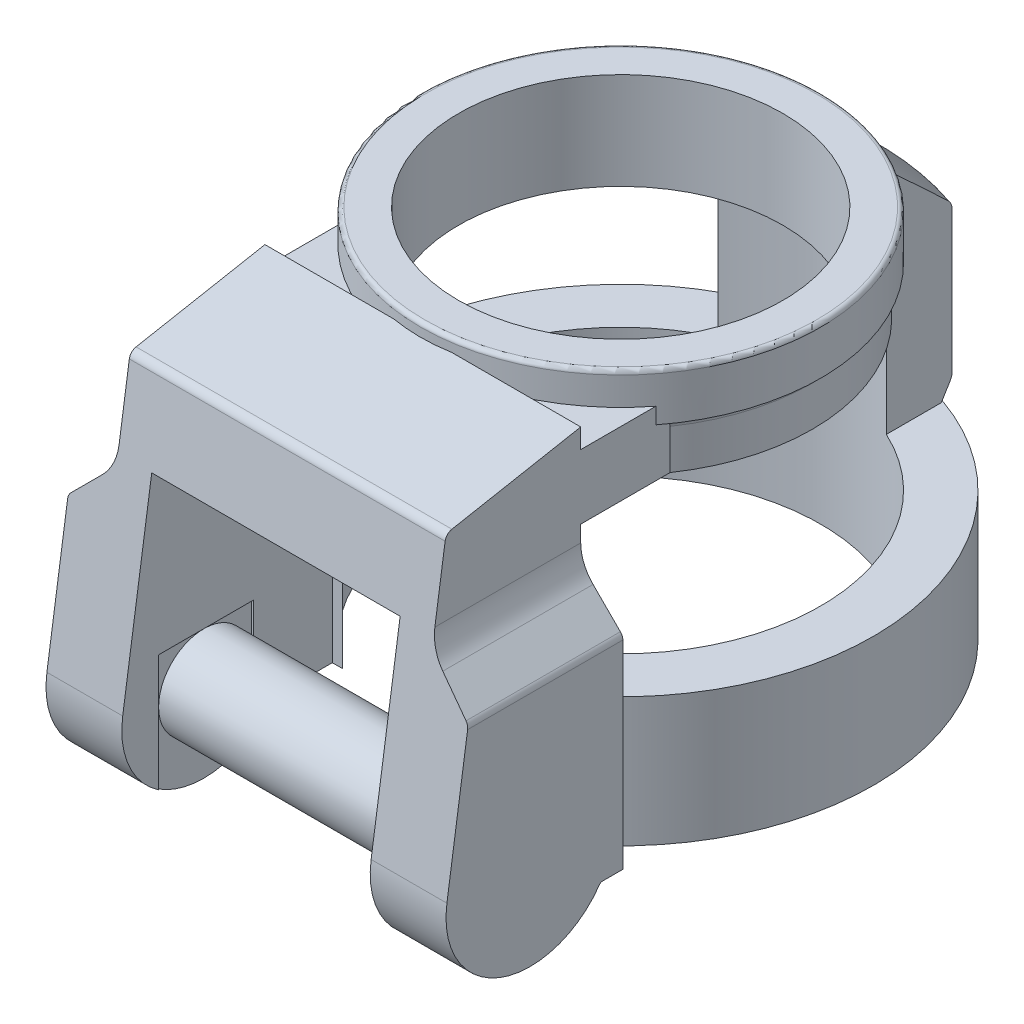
ISO-10303-21;
HEADER;
FILE_DESCRIPTION(('STEP AP214'),'2;1');
FILE_NAME('part.step','',(''),(''),'','','');
FILE_SCHEMA(('AUTOMOTIVE_DESIGN { 1 0 10303 214 1 1 1 1 }'));
ENDSEC;
DATA;
#1=APPLICATION_CONTEXT('core data for automotive mechanical design processes');
#2=APPLICATION_PROTOCOL_DEFINITION('international standard','automotive_design',2000,#1);
#3=PRODUCT_CONTEXT('',#1,'mechanical');
#4=PRODUCT('Part','Part','',(#3));
#5=PRODUCT_RELATED_PRODUCT_CATEGORY('part','',(#4));
#6=PRODUCT_DEFINITION_FORMATION('','',#4);
#7=PRODUCT_DEFINITION_CONTEXT('part definition',#1,'design');
#8=PRODUCT_DEFINITION('design','',#6,#7);
#9=PRODUCT_DEFINITION_SHAPE('','',#8);
#10=(LENGTH_UNIT() NAMED_UNIT(*) SI_UNIT(.MILLI.,.METRE.));
#11=(NAMED_UNIT(*) PLANE_ANGLE_UNIT() SI_UNIT($,.RADIAN.));
#12=(NAMED_UNIT(*) SI_UNIT($,.STERADIAN.) SOLID_ANGLE_UNIT());
#13=UNCERTAINTY_MEASURE_WITH_UNIT(LENGTH_MEASURE(1.E-05),#10,'distance_accuracy_value','');
#14=(GEOMETRIC_REPRESENTATION_CONTEXT(3) GLOBAL_UNCERTAINTY_ASSIGNED_CONTEXT((#13)) GLOBAL_UNIT_ASSIGNED_CONTEXT((#10,
#11,#12)) REPRESENTATION_CONTEXT('',''));
#15=CARTESIAN_POINT('',(0.,0.,0.));
#16=DIRECTION('',(0.,0.,1.));
#17=DIRECTION('',(1.,0.,0.));
#18=AXIS2_PLACEMENT_3D('',#15,#16,#17);
#19=CARTESIAN_POINT('',(31.,0.,0.));
#20=DIRECTION('',(-1.,0.,0.));
#21=DIRECTION('',(0.,0.,1.));
#22=AXIS2_PLACEMENT_3D('',#19,#20,#21);
#23=CYLINDRICAL_SURFACE('',#22,10.75);
#24=CARTESIAN_POINT('',(-30.,0.,0.));
#25=DIRECTION('',(-1.,0.,0.));
#26=DIRECTION('',(0.,0.,1.));
#27=AXIS2_PLACEMENT_3D('',#24,#25,#26);
#28=CIRCLE('',#27,10.75);
#29=CARTESIAN_POINT('',(-30.,0.,10.75));
#30=VERTEX_POINT('',#29);
#31=EDGE_CURVE('E19',#30,#30,#28,.T.);
#32=ORIENTED_EDGE('',*,*,#31,.F.);
#33=EDGE_LOOP('',(#32));
#34=FACE_BOUND('',#33,.T.);
#35=CARTESIAN_POINT('',(30.,0.,0.));
#36=DIRECTION('',(-1.,0.,0.));
#37=DIRECTION('',(0.,0.,1.));
#38=AXIS2_PLACEMENT_3D('',#35,#36,#37);
#39=CIRCLE('',#38,10.75);
#40=CARTESIAN_POINT('',(30.,0.,10.75));
#41=VERTEX_POINT('',#40);
#42=EDGE_CURVE('E380',#41,#41,#39,.F.);
#43=ORIENTED_EDGE('',*,*,#42,.F.);
#44=EDGE_LOOP('',(#43));
#45=FACE_BOUND('',#44,.T.);
#46=ADVANCED_FACE('F16',(#34,#45),#23,.T.);
#47=CARTESIAN_POINT('',(0.,78.,-30.5));
#48=DIRECTION('',(0.,1.,0.));
#49=DIRECTION('',(0.,0.,1.));
#50=AXIS2_PLACEMENT_3D('',#47,#48,#49);
#51=PLANE('',#50);
#52=CARTESIAN_POINT('',(0.,78.,-69.));
#53=DIRECTION('',(0.,-1.,0.));
#54=DIRECTION('',(0.,0.,-1.));
#55=AXIS2_PLACEMENT_3D('',#52,#53,#54);
#56=CIRCLE('',#55,38.5);
#57=CARTESIAN_POINT('',(0.,78.,-107.5));
#58=VERTEX_POINT('',#57);
#59=EDGE_CURVE('E699',#58,#58,#56,.T.);
#60=ORIENTED_EDGE('',*,*,#59,.T.);
#61=EDGE_LOOP('',(#60));
#62=FACE_BOUND('',#61,.T.);
#63=CARTESIAN_POINT('',(0.,78.,-69.));
#64=DIRECTION('',(0.,-1.,0.));
#65=DIRECTION('',(0.,0.,1.));
#66=AXIS2_PLACEMENT_3D('',#63,#64,#65);
#67=CIRCLE('',#66,46.5);
#68=CARTESIAN_POINT('',(1.95112267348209E-13,78.,-22.5));
#69=VERTEX_POINT('',#68);
#70=EDGE_CURVE('E734',#69,#69,#67,.T.);
#71=ORIENTED_EDGE('',*,*,#70,.F.);
#72=EDGE_LOOP('',(#71));
#73=FACE_BOUND('',#72,.T.);
#74=ADVANCED_FACE('F745',(#62,#73),#51,.T.);
#75=CARTESIAN_POINT('',(-30.,11.25,11.25));
#76=DIRECTION('',(1.,0.,0.));
#77=DIRECTION('',(0.,0.,-1.));
#78=AXIS2_PLACEMENT_3D('',#75,#76,#77);
#79=PLANE('',#78);
#80=ORIENTED_EDGE('',*,*,#31,.T.);
#81=EDGE_LOOP('',(#80));
#82=FACE_BOUND('',#81,.T.);
#83=DIRECTION('',(0.,0.,1.));
#84=VECTOR('',#83,1.);
#85=CARTESIAN_POINT('',(-30.,11.25,11.25));
#86=LINE('',#85,#84);
#87=CARTESIAN_POINT('',(-30.,11.25,11.25));
#88=VERTEX_POINT('',#87);
#89=CARTESIAN_POINT('',(-30.,11.25,-11.25));
#90=VERTEX_POINT('',#89);
#91=EDGE_CURVE('E652',#88,#90,#86,.F.);
#92=ORIENTED_EDGE('',*,*,#91,.F.);
#93=DIRECTION('',(0.,1.,0.));
#94=VECTOR('',#93,1.);
#95=CARTESIAN_POINT('',(-30.,0.,11.25));
#96=LINE('',#95,#94);
#97=CARTESIAN_POINT('',(-30.,-16.5359456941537,11.25));
#98=VERTEX_POINT('',#97);
#99=EDGE_CURVE('E665',#88,#98,#96,.F.);
#100=ORIENTED_EDGE('',*,*,#99,.T.);
#101=CARTESIAN_POINT('',(-30.,0.,0.));
#102=DIRECTION('',(1.,0.,0.));
#103=DIRECTION('',(0.,0.,-1.));
#104=AXIS2_PLACEMENT_3D('',#101,#102,#103);
#105=CIRCLE('',#104,20.);
#106=CARTESIAN_POINT('',(-30.,-16.5359456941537,-11.25));
#107=VERTEX_POINT('',#106);
#108=EDGE_CURVE('E640',#107,#98,#105,.F.);
#109=ORIENTED_EDGE('',*,*,#108,.F.);
#110=DIRECTION('',(0.,1.,0.));
#111=VECTOR('',#110,1.);
#112=CARTESIAN_POINT('',(-30.,0.,-11.25));
#113=LINE('',#112,#111);
#114=EDGE_CURVE('E425',#90,#107,#113,.F.);
#115=ORIENTED_EDGE('',*,*,#114,.F.);
#116=EDGE_LOOP('',(#92,#100,#109,#115));
#117=FACE_BOUND('',#116,.T.);
#118=ADVANCED_FACE('F434',(#82,#117),#79,.T.);
#119=CARTESIAN_POINT('',(0.,77.,-69.));
#120=DIRECTION('',(0.,1.,0.));
#121=DIRECTION('',(0.,0.,1.));
#122=AXIS2_PLACEMENT_3D('',#119,#120,#121);
#123=TOROIDAL_SURFACE('',#122,46.5,1.);
#124=ORIENTED_EDGE('',*,*,#70,.T.);
#125=EDGE_LOOP('',(#124));
#126=FACE_BOUND('',#125,.T.);
#127=CARTESIAN_POINT('',(0.,77.,-69.));
#128=DIRECTION('',(0.,-1.,0.));
#129=DIRECTION('',(0.,0.,-1.));
#130=AXIS2_PLACEMENT_3D('',#127,#128,#129);
#131=CIRCLE('',#130,47.5);
#132=CARTESIAN_POINT('',(0.,77.,-116.5));
#133=VERTEX_POINT('',#132);
#134=EDGE_CURVE('E534',#133,#133,#131,.T.);
#135=ORIENTED_EDGE('',*,*,#134,.F.);
#136=EDGE_LOOP('',(#135));
#137=FACE_BOUND('',#136,.T.);
#138=ADVANCED_FACE('F428',(#126,#137),#123,.T.);
#139=CARTESIAN_POINT('',(30.,-45.,11.25));
#140=DIRECTION('',(-1.,0.,0.));
#141=DIRECTION('',(0.,0.,1.));
#142=AXIS2_PLACEMENT_3D('',#139,#140,#141);
#143=PLANE('',#142);
#144=ORIENTED_EDGE('',*,*,#42,.T.);
#145=EDGE_LOOP('',(#144));
#146=FACE_BOUND('',#145,.T.);
#147=DIRECTION('',(0.,0.,1.));
#148=VECTOR('',#147,1.);
#149=CARTESIAN_POINT('',(30.,11.25,11.25));
#150=LINE('',#149,#148);
#151=CARTESIAN_POINT('',(30.,11.25,-11.25));
#152=VERTEX_POINT('',#151);
#153=CARTESIAN_POINT('',(30.,11.25,11.25));
#154=VERTEX_POINT('',#153);
#155=EDGE_CURVE('E412',#152,#154,#150,.T.);
#156=ORIENTED_EDGE('',*,*,#155,.F.);
#157=DIRECTION('',(0.,1.,0.));
#158=VECTOR('',#157,1.);
#159=CARTESIAN_POINT('',(30.,0.,-11.25));
#160=LINE('',#159,#158);
#161=CARTESIAN_POINT('',(30.,-16.5359456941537,-11.25));
#162=VERTEX_POINT('',#161);
#163=EDGE_CURVE('E418',#162,#152,#160,.T.);
#164=ORIENTED_EDGE('',*,*,#163,.F.);
#165=CARTESIAN_POINT('',(30.,0.,0.));
#166=DIRECTION('',(1.,0.,0.));
#167=DIRECTION('',(0.,0.,-1.));
#168=AXIS2_PLACEMENT_3D('',#165,#166,#167);
#169=CIRCLE('',#168,20.);
#170=CARTESIAN_POINT('',(30.,-16.5359456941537,11.25));
#171=VERTEX_POINT('',#170);
#172=EDGE_CURVE('E1083',#171,#162,#169,.T.);
#173=ORIENTED_EDGE('',*,*,#172,.F.);
#174=DIRECTION('',(0.,1.,0.));
#175=VECTOR('',#174,1.);
#176=CARTESIAN_POINT('',(30.,0.,11.25));
#177=LINE('',#176,#175);
#178=EDGE_CURVE('E406',#171,#154,#177,.T.);
#179=ORIENTED_EDGE('',*,*,#178,.T.);
#180=EDGE_LOOP('',(#156,#164,#173,#179));
#181=FACE_BOUND('',#180,.T.);
#182=ADVANCED_FACE('F433',(#146,#181),#143,.T.);
#183=CARTESIAN_POINT('',(0.,70.3333333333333,-69.));
#184=DIRECTION('',(0.,-1.,0.));
#185=DIRECTION('',(0.,0.,-1.));
#186=AXIS2_PLACEMENT_3D('',#183,#184,#185);
#187=PLANE('',#186);
#188=CARTESIAN_POINT('',(0.,70.3333333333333,-69.));
#189=DIRECTION('',(0.,-1.,0.));
#190=DIRECTION('',(0.,0.,-1.));
#191=AXIS2_PLACEMENT_3D('',#188,#189,#190);
#192=CIRCLE('',#191,47.5);
#193=CARTESIAN_POINT('',(6.87386354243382,70.3333333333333,-22.));
#194=VERTEX_POINT('',#193);
#195=CARTESIAN_POINT('',(37.5,70.3333333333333,-39.8452405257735));
#196=VERTEX_POINT('',#195);
#197=EDGE_CURVE('E378',#194,#196,#192,.F.);
#198=ORIENTED_EDGE('',*,*,#197,.F.);
#199=DIRECTION('',(1.,0.,0.));
#200=VECTOR('',#199,1.);
#201=CARTESIAN_POINT('',(90.,70.3333333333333,-22.));
#202=LINE('',#201,#200);
#203=CARTESIAN_POINT('',(37.5,70.3333333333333,-22.));
#204=VERTEX_POINT('',#203);
#205=EDGE_CURVE('E373',#194,#204,#202,.T.);
#206=ORIENTED_EDGE('',*,*,#205,.T.);
#207=DIRECTION('',(0.,0.,-1.));
#208=VECTOR('',#207,1.);
#209=CARTESIAN_POINT('',(37.5,70.3333333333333,90.));
#210=LINE('',#209,#208);
#211=EDGE_CURVE('E376',#196,#204,#210,.F.);
#212=ORIENTED_EDGE('',*,*,#211,.F.);
#213=EDGE_LOOP('',(#198,#206,#212));
#214=FACE_BOUND('',#213,.T.);
#215=ADVANCED_FACE('F374',(#214),#187,.F.);
#216=CARTESIAN_POINT('',(90.,70.3333333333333,-22.));
#217=DIRECTION('',(0.,0.,1.));
#218=DIRECTION('',(1.,0.,0.));
#219=AXIS2_PLACEMENT_3D('',#216,#217,#218);
#220=PLANE('',#219);
#221=DIRECTION('',(0.,-1.,0.));
#222=VECTOR('',#221,1.);
#223=CARTESIAN_POINT('',(6.87386354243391,132.,-22.));
#224=LINE('',#223,#222);
#225=CARTESIAN_POINT('',(6.87386354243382,75.,-22.));
#226=VERTEX_POINT('',#225);
#227=EDGE_CURVE('E543',#226,#194,#224,.T.);
#228=ORIENTED_EDGE('',*,*,#227,.F.);
#229=DIRECTION('',(1.,0.,0.));
#230=VECTOR('',#229,1.);
#231=CARTESIAN_POINT('',(90.,75.,-22.));
#232=LINE('',#231,#230);
#233=CARTESIAN_POINT('',(37.5,75.,-22.));
#234=VERTEX_POINT('',#233);
#235=EDGE_CURVE('E367',#226,#234,#232,.T.);
#236=ORIENTED_EDGE('',*,*,#235,.T.);
#237=DIRECTION('',(0.,1.,0.));
#238=VECTOR('',#237,1.);
#239=CARTESIAN_POINT('',(37.5,132.,-22.));
#240=LINE('',#239,#238);
#241=EDGE_CURVE('E383',#204,#234,#240,.T.);
#242=ORIENTED_EDGE('',*,*,#241,.F.);
#243=ORIENTED_EDGE('',*,*,#205,.F.);
#244=EDGE_LOOP('',(#228,#236,#242,#243));
#245=FACE_BOUND('',#244,.T.);
#246=ADVANCED_FACE('F384',(#245),#220,.F.);
#247=CARTESIAN_POINT('',(45.5,36.1715728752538,90.));
#248=DIRECTION('',(0.,0.,1.));
#249=DIRECTION('',(1.,0.,0.));
#250=AXIS2_PLACEMENT_3D('',#247,#248,#249);
#251=CYLINDRICAL_SURFACE('',#250,2.);
#252=DIRECTION('',(0.,0.,1.));
#253=VECTOR('',#252,1.);
#254=CARTESIAN_POINT('',(46.9142135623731,37.5857864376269,90.));
#255=LINE('',#254,#253);
#256=CARTESIAN_POINT('',(46.9142135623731,37.5857864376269,14.6520867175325));
#257=VERTEX_POINT('',#256);
#258=CARTESIAN_POINT('',(46.9142135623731,37.5857864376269,-22.));
#259=VERTEX_POINT('',#258);
#260=EDGE_CURVE('E404',#257,#259,#255,.F.);
#261=ORIENTED_EDGE('',*,*,#260,.F.);
#262=CARTESIAN_POINT('',(45.5,36.1715728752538,14.861515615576));
#263=DIRECTION('',(0.,-0.146491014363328,-0.989212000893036));
#264=DIRECTION('',(0.,-0.989212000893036,0.146491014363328));
#265=AXIS2_PLACEMENT_3D('',#262,#263,#264);
#266=ELLIPSE('',#265,2.0218112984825,2.);
#267=CARTESIAN_POINT('',(47.5,36.1715728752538,14.861515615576));
#268=VERTEX_POINT('',#267);
#269=EDGE_CURVE('E701',#257,#268,#266,.T.);
#270=ORIENTED_EDGE('',*,*,#269,.T.);
#271=DIRECTION('',(0.,0.,-1.));
#272=VECTOR('',#271,1.);
#273=CARTESIAN_POINT('',(47.5,36.1715728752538,90.));
#274=LINE('',#273,#272);
#275=CARTESIAN_POINT('',(47.5,36.1715728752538,-22.));
#276=VERTEX_POINT('',#275);
#277=EDGE_CURVE('E646',#276,#268,#274,.F.);
#278=ORIENTED_EDGE('',*,*,#277,.F.);
#279=CARTESIAN_POINT('',(45.5,36.1715728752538,-22.));
#280=DIRECTION('',(0.,0.,1.));
#281=DIRECTION('',(1.,0.,0.));
#282=AXIS2_PLACEMENT_3D('',#279,#280,#281);
#283=CIRCLE('',#282,2.);
#284=EDGE_CURVE('E317',#276,#259,#283,.T.);
#285=ORIENTED_EDGE('',*,*,#284,.T.);
#286=EDGE_LOOP('',(#261,#270,#278,#285));
#287=FACE_BOUND('',#286,.T.);
#288=ADVANCED_FACE('F1430',(#287),#251,.T.);
#289=CARTESIAN_POINT('',(0.,132.,-69.));
#290=DIRECTION('',(0.,-1.,0.));
#291=DIRECTION('',(0.,0.,-1.));
#292=AXIS2_PLACEMENT_3D('',#289,#290,#291);
#293=CYLINDRICAL_SURFACE('',#292,38.5);
#294=CARTESIAN_POINT('',(0.,55.,-69.));
#295=DIRECTION('',(0.,-1.,0.));
#296=DIRECTION('',(0.,0.,-1.));
#297=AXIS2_PLACEMENT_3D('',#294,#295,#296);
#298=CIRCLE('',#297,38.5);
#299=CARTESIAN_POINT('',(0.,55.,-107.5));
#300=VERTEX_POINT('',#299);
#301=EDGE_CURVE('E998',#300,#300,#298,.T.);
#302=ORIENTED_EDGE('',*,*,#301,.T.);
#303=EDGE_LOOP('',(#302));
#304=FACE_BOUND('',#303,.T.);
#305=ORIENTED_EDGE('',*,*,#59,.F.);
#306=EDGE_LOOP('',(#305));
#307=FACE_BOUND('',#306,.T.);
#308=ADVANCED_FACE('F1422',(#304,#307),#293,.F.);
#309=CARTESIAN_POINT('',(90.,67.2969490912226,8.23039111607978));
#310=DIRECTION('',(1.,0.,0.));
#311=DIRECTION('',(0.,0.,-1.));
#312=AXIS2_PLACEMENT_3D('',#309,#310,#311);
#313=CYLINDRICAL_SURFACE('',#312,2.);
#314=CARTESIAN_POINT('',(-37.5,67.2969490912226,8.23039111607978));
#315=DIRECTION('',(1.,0.,0.));
#316=DIRECTION('',(0.,0.,-1.));
#317=AXIS2_PLACEMENT_3D('',#314,#315,#316);
#318=CIRCLE('',#317,2.);
#319=CARTESIAN_POINT('',(-37.5,67.5899311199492,10.2088151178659));
#320=VERTEX_POINT('',#319);
#321=CARTESIAN_POINT('',(-37.5,69.2626934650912,8.59896818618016));
#322=VERTEX_POINT('',#321);
#323=EDGE_CURVE('E984',#320,#322,#318,.F.);
#324=ORIENTED_EDGE('',*,*,#323,.F.);
#325=DIRECTION('',(1.,0.,0.));
#326=VECTOR('',#325,1.);
#327=CARTESIAN_POINT('',(90.,67.5899311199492,10.2088151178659));
#328=LINE('',#327,#326);
#329=CARTESIAN_POINT('',(37.5,67.5899311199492,10.2088151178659));
#330=VERTEX_POINT('',#329);
#331=EDGE_CURVE('E700',#320,#330,#328,.T.);
#332=ORIENTED_EDGE('',*,*,#331,.T.);
#333=CARTESIAN_POINT('',(37.5,67.2969490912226,8.23039111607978));
#334=DIRECTION('',(1.,0.,0.));
#335=DIRECTION('',(0.,0.,-1.));
#336=AXIS2_PLACEMENT_3D('',#333,#334,#335);
#337=CIRCLE('',#336,2.);
#338=CARTESIAN_POINT('',(37.5,69.2626934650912,8.59896818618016));
#339=VERTEX_POINT('',#338);
#340=EDGE_CURVE('E1044',#339,#330,#337,.T.);
#341=ORIENTED_EDGE('',*,*,#340,.F.);
#342=DIRECTION('',(1.,0.,0.));
#343=VECTOR('',#342,1.);
#344=CARTESIAN_POINT('',(90.,69.2626934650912,8.59896818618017));
#345=LINE('',#344,#343);
#346=EDGE_CURVE('E695',#339,#322,#345,.F.);
#347=ORIENTED_EDGE('',*,*,#346,.T.);
#348=EDGE_LOOP('',(#324,#332,#341,#347));
#349=FACE_BOUND('',#348,.T.);
#350=ADVANCED_FACE('F1413',(#349),#313,.T.);
#351=CARTESIAN_POINT('',(90.,75.,-22.));
#352=DIRECTION('',(0.,-0.982872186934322,-0.184288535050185));
#353=DIRECTION('',(0.,0.184288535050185,-0.982872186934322));
#354=AXIS2_PLACEMENT_3D('',#351,#352,#353);
#355=PLANE('',#354);
#356=CARTESIAN_POINT('',(0.,83.8125,-69.));
#357=DIRECTION('',(0.,-0.982872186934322,-0.184288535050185));
#358=DIRECTION('',(0.,-0.184288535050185,0.982872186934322));
#359=AXIS2_PLACEMENT_3D('',#356,#357,#358);
#360=ELLIPSE('',#359,48.327748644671,47.5);
#361=CARTESIAN_POINT('',(-6.87386354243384,75.,-22.));
#362=VERTEX_POINT('',#361);
#363=EDGE_CURVE('E545',#362,#226,#360,.F.);
#364=ORIENTED_EDGE('',*,*,#363,.F.);
#365=DIRECTION('',(1.,0.,0.));
#366=VECTOR('',#365,1.);
#367=CARTESIAN_POINT('',(90.,75.,-22.));
#368=LINE('',#367,#366);
#369=CARTESIAN_POINT('',(-37.5,75.,-22.));
#370=VERTEX_POINT('',#369);
#371=EDGE_CURVE('E676',#362,#370,#368,.F.);
#372=ORIENTED_EDGE('',*,*,#371,.T.);
#373=DIRECTION('',(0.,0.184288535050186,-0.982872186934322));
#374=VECTOR('',#373,1.);
#375=CARTESIAN_POINT('',(-37.5,69.2626934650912,8.59896818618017));
#376=LINE('',#375,#374);
#377=EDGE_CURVE('E688',#322,#370,#376,.T.);
#378=ORIENTED_EDGE('',*,*,#377,.F.);
#379=ORIENTED_EDGE('',*,*,#346,.F.);
#380=DIRECTION('',(0.,-0.184288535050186,0.982872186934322));
#381=VECTOR('',#380,1.);
#382=CARTESIAN_POINT('',(37.5,75.,-22.));
#383=LINE('',#382,#381);
#384=EDGE_CURVE('E387',#234,#339,#383,.T.);
#385=ORIENTED_EDGE('',*,*,#384,.F.);
#386=ORIENTED_EDGE('',*,*,#235,.F.);
#387=EDGE_LOOP('',(#364,#372,#378,#379,#385,#386));
#388=FACE_BOUND('',#387,.T.);
#389=ADVANCED_FACE('F1404',(#388),#355,.F.);
#390=CARTESIAN_POINT('',(90.,70.3333333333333,-22.));
#391=DIRECTION('',(0.,0.,1.));
#392=DIRECTION('',(1.,0.,0.));
#393=AXIS2_PLACEMENT_3D('',#390,#391,#392);
#394=PLANE('',#393);
#395=DIRECTION('',(0.,-1.,0.));
#396=VECTOR('',#395,1.);
#397=CARTESIAN_POINT('',(-6.87386354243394,132.,-22.));
#398=LINE('',#397,#396);
#399=CARTESIAN_POINT('',(-6.87386354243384,70.3333333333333,-22.));
#400=VERTEX_POINT('',#399);
#401=EDGE_CURVE('E537',#400,#362,#398,.F.);
#402=ORIENTED_EDGE('',*,*,#401,.F.);
#403=DIRECTION('',(1.,0.,0.));
#404=VECTOR('',#403,1.);
#405=CARTESIAN_POINT('',(0.,70.3333333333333,-22.));
#406=LINE('',#405,#404);
#407=CARTESIAN_POINT('',(-37.5,70.3333333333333,-22.));
#408=VERTEX_POINT('',#407);
#409=EDGE_CURVE('E673',#400,#408,#406,.F.);
#410=ORIENTED_EDGE('',*,*,#409,.T.);
#411=DIRECTION('',(0.,1.,0.));
#412=VECTOR('',#411,1.);
#413=CARTESIAN_POINT('',(-37.5,51.142135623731,-22.));
#414=LINE('',#413,#412);
#415=EDGE_CURVE('E683',#370,#408,#414,.F.);
#416=ORIENTED_EDGE('',*,*,#415,.F.);
#417=ORIENTED_EDGE('',*,*,#371,.F.);
#418=EDGE_LOOP('',(#402,#410,#416,#417));
#419=FACE_BOUND('',#418,.T.);
#420=ADVANCED_FACE('F1395',(#419),#394,.F.);
#421=CARTESIAN_POINT('',(0.,70.3333333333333,-69.));
#422=DIRECTION('',(0.,-1.,0.));
#423=DIRECTION('',(0.,0.,-1.));
#424=AXIS2_PLACEMENT_3D('',#421,#422,#423);
#425=PLANE('',#424);
#426=CARTESIAN_POINT('',(0.,70.3333333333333,-69.));
#427=DIRECTION('',(0.,-1.,0.));
#428=DIRECTION('',(0.,0.,-1.));
#429=AXIS2_PLACEMENT_3D('',#426,#427,#428);
#430=CIRCLE('',#429,47.5);
#431=CARTESIAN_POINT('',(-37.5,70.3333333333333,-39.8452405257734));
#432=VERTEX_POINT('',#431);
#433=EDGE_CURVE('E542',#432,#400,#430,.F.);
#434=ORIENTED_EDGE('',*,*,#433,.F.);
#435=DIRECTION('',(0.,0.,1.));
#436=VECTOR('',#435,1.);
#437=CARTESIAN_POINT('',(-37.5,70.3333333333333,90.));
#438=LINE('',#437,#436);
#439=EDGE_CURVE('E679',#408,#432,#438,.F.);
#440=ORIENTED_EDGE('',*,*,#439,.F.);
#441=ORIENTED_EDGE('',*,*,#409,.F.);
#442=EDGE_LOOP('',(#434,#440,#441));
#443=FACE_BOUND('',#442,.T.);
#444=ADVANCED_FACE('F1387',(#443),#425,.F.);
#445=CARTESIAN_POINT('',(-45.5,36.1715728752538,90.));
#446=DIRECTION('',(0.,0.,1.));
#447=DIRECTION('',(1.,0.,0.));
#448=AXIS2_PLACEMENT_3D('',#445,#446,#447);
#449=CYLINDRICAL_SURFACE('',#448,2.);
#450=DIRECTION('',(0.,0.,1.));
#451=VECTOR('',#450,1.);
#452=CARTESIAN_POINT('',(-47.5,36.1715728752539,90.));
#453=LINE('',#452,#451);
#454=CARTESIAN_POINT('',(-47.5,36.1715728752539,14.861515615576));
#455=VERTEX_POINT('',#454);
#456=CARTESIAN_POINT('',(-47.5,36.1715728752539,-22.));
#457=VERTEX_POINT('',#456);
#458=EDGE_CURVE('E971',#455,#457,#453,.F.);
#459=ORIENTED_EDGE('',*,*,#458,.F.);
#460=CARTESIAN_POINT('',(-45.5,36.1715728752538,14.861515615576));
#461=DIRECTION('',(0.,-0.146491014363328,-0.989212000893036));
#462=DIRECTION('',(0.,-0.989212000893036,0.146491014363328));
#463=AXIS2_PLACEMENT_3D('',#460,#461,#462);
#464=ELLIPSE('',#463,2.0218112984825,2.);
#465=CARTESIAN_POINT('',(-46.9142135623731,37.5857864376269,14.6520867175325));
#466=VERTEX_POINT('',#465);
#467=EDGE_CURVE('E642',#455,#466,#464,.T.);
#468=ORIENTED_EDGE('',*,*,#467,.T.);
#469=DIRECTION('',(0.,0.,1.));
#470=VECTOR('',#469,1.);
#471=CARTESIAN_POINT('',(-46.9142135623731,37.5857864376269,90.));
#472=LINE('',#471,#470);
#473=CARTESIAN_POINT('',(-46.9142135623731,37.5857864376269,-22.));
#474=VERTEX_POINT('',#473);
#475=EDGE_CURVE('E972',#474,#466,#472,.T.);
#476=ORIENTED_EDGE('',*,*,#475,.F.);
#477=CARTESIAN_POINT('',(-45.5,36.1715728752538,-22.));
#478=DIRECTION('',(0.,0.,1.));
#479=DIRECTION('',(1.,0.,0.));
#480=AXIS2_PLACEMENT_3D('',#477,#478,#479);
#481=CIRCLE('',#480,2.);
#482=EDGE_CURVE('E675',#474,#457,#481,.T.);
#483=ORIENTED_EDGE('',*,*,#482,.T.);
#484=EDGE_LOOP('',(#459,#468,#476,#483));
#485=FACE_BOUND('',#484,.T.);
#486=ADVANCED_FACE('F1175',(#485),#449,.T.);
#487=CARTESIAN_POINT('',(0.,0.,11.25));
#488=DIRECTION('',(0.,0.,1.));
#489=DIRECTION('',(1.,0.,0.));
#490=AXIS2_PLACEMENT_3D('',#487,#488,#489);
#491=PLANE('',#490);
#492=DIRECTION('',(1.,0.,0.));
#493=VECTOR('',#492,1.);
#494=CARTESIAN_POINT('',(30.,11.25,11.25));
#495=LINE('',#494,#493);
#496=CARTESIAN_POINT('',(-29.5,11.25,11.25));
#497=VERTEX_POINT('',#496);
#498=EDGE_CURVE('E662',#497,#88,#495,.F.);
#499=ORIENTED_EDGE('',*,*,#498,.F.);
#500=DIRECTION('',(0.,1.,0.));
#501=VECTOR('',#500,1.);
#502=CARTESIAN_POINT('',(-29.5,49.5,11.25));
#503=LINE('',#502,#501);
#504=CARTESIAN_POINT('',(-29.5,-16.5359456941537,11.25));
#505=VERTEX_POINT('',#504);
#506=EDGE_CURVE('E659',#505,#497,#503,.T.);
#507=ORIENTED_EDGE('',*,*,#506,.F.);
#508=DIRECTION('',(1.,0.,0.));
#509=VECTOR('',#508,1.);
#510=CARTESIAN_POINT('',(90.,-16.5359456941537,11.25));
#511=LINE('',#510,#509);
#512=EDGE_CURVE('E637',#98,#505,#511,.T.);
#513=ORIENTED_EDGE('',*,*,#512,.F.);
#514=ORIENTED_EDGE('',*,*,#99,.F.);
#515=EDGE_LOOP('',(#499,#507,#513,#514));
#516=FACE_BOUND('',#515,.T.);
#517=ADVANCED_FACE('F1370',(#516),#491,.F.);
#518=CARTESIAN_POINT('',(30.,11.25,11.25));
#519=DIRECTION('',(0.,-1.,0.));
#520=DIRECTION('',(1.,0.,0.));
#521=AXIS2_PLACEMENT_3D('',#518,#519,#520);
#522=PLANE('',#521);
#523=DIRECTION('',(1.,0.,0.));
#524=VECTOR('',#523,1.);
#525=CARTESIAN_POINT('',(0.,11.25,-11.25));
#526=LINE('',#525,#524);
#527=CARTESIAN_POINT('',(-29.5,11.25,-11.25));
#528=VERTEX_POINT('',#527);
#529=EDGE_CURVE('E649',#528,#90,#526,.F.);
#530=ORIENTED_EDGE('',*,*,#529,.F.);
#531=DIRECTION('',(0.,0.,-1.));
#532=VECTOR('',#531,1.);
#533=CARTESIAN_POINT('',(-29.5,11.25,30.));
#534=LINE('',#533,#532);
#535=EDGE_CURVE('E655',#497,#528,#534,.T.);
#536=ORIENTED_EDGE('',*,*,#535,.F.);
#537=ORIENTED_EDGE('',*,*,#498,.T.);
#538=ORIENTED_EDGE('',*,*,#91,.T.);
#539=EDGE_LOOP('',(#530,#536,#537,#538));
#540=FACE_BOUND('',#539,.T.);
#541=ADVANCED_FACE('F1361',(#540),#522,.T.);
#542=CARTESIAN_POINT('',(0.,0.,-11.25));
#543=DIRECTION('',(0.,0.,1.));
#544=DIRECTION('',(1.,0.,0.));
#545=AXIS2_PLACEMENT_3D('',#542,#543,#544);
#546=PLANE('',#545);
#547=ORIENTED_EDGE('',*,*,#529,.T.);
#548=ORIENTED_EDGE('',*,*,#114,.T.);
#549=DIRECTION('',(1.,0.,0.));
#550=VECTOR('',#549,1.);
#551=CARTESIAN_POINT('',(90.,-16.5359456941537,-11.25));
#552=LINE('',#551,#550);
#553=CARTESIAN_POINT('',(-29.5,-16.5359456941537,-11.25));
#554=VERTEX_POINT('',#553);
#555=EDGE_CURVE('E636',#554,#107,#552,.F.);
#556=ORIENTED_EDGE('',*,*,#555,.F.);
#557=DIRECTION('',(0.,1.,0.));
#558=VECTOR('',#557,1.);
#559=CARTESIAN_POINT('',(-29.5,49.5,-11.25));
#560=LINE('',#559,#558);
#561=EDGE_CURVE('E658',#528,#554,#560,.F.);
#562=ORIENTED_EDGE('',*,*,#561,.F.);
#563=EDGE_LOOP('',(#547,#548,#556,#562));
#564=FACE_BOUND('',#563,.T.);
#565=ADVANCED_FACE('F1353',(#564),#546,.T.);
#566=CARTESIAN_POINT('',(90.,0.,0.));
#567=DIRECTION('',(1.,0.,0.));
#568=DIRECTION('',(0.,0.,-1.));
#569=AXIS2_PLACEMENT_3D('',#566,#567,#568);
#570=CYLINDRICAL_SURFACE('',#569,20.);
#571=CARTESIAN_POINT('',(-29.5,0.,0.));
#572=DIRECTION('',(1.,0.,0.));
#573=DIRECTION('',(0.,0.,-1.));
#574=AXIS2_PLACEMENT_3D('',#571,#572,#573);
#575=CIRCLE('',#574,20.);
#576=CARTESIAN_POINT('',(-29.5,-11.4285714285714,-16.4130361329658));
#577=VERTEX_POINT('',#576);
#578=EDGE_CURVE('E940',#554,#577,#575,.T.);
#579=ORIENTED_EDGE('',*,*,#578,.F.);
#580=ORIENTED_EDGE('',*,*,#555,.T.);
#581=ORIENTED_EDGE('',*,*,#108,.T.);
#582=ORIENTED_EDGE('',*,*,#512,.T.);
#583=CARTESIAN_POINT('',(-29.5,0.,0.));
#584=DIRECTION('',(1.,0.,0.));
#585=DIRECTION('',(0.,0.,-1.));
#586=AXIS2_PLACEMENT_3D('',#583,#584,#585);
#587=CIRCLE('',#586,20.);
#588=CARTESIAN_POINT('',(-29.5,2.92982028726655,19.7842400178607));
#589=VERTEX_POINT('',#588);
#590=EDGE_CURVE('E615',#589,#505,#587,.T.);
#591=ORIENTED_EDGE('',*,*,#590,.F.);
#592=DIRECTION('',(1.,0.,0.));
#593=VECTOR('',#592,1.);
#594=CARTESIAN_POINT('',(90.,2.92982028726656,19.7842400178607));
#595=LINE('',#594,#593);
#596=CARTESIAN_POINT('',(-47.5,2.92982028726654,19.7842400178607));
#597=VERTEX_POINT('',#596);
#598=EDGE_CURVE('E408',#589,#597,#595,.F.);
#599=ORIENTED_EDGE('',*,*,#598,.T.);
#600=CARTESIAN_POINT('',(-47.5,0.,0.));
#601=DIRECTION('',(1.,0.,0.));
#602=DIRECTION('',(0.,0.,-1.));
#603=AXIS2_PLACEMENT_3D('',#600,#601,#602);
#604=CIRCLE('',#603,20.);
#605=CARTESIAN_POINT('',(-47.5,-11.4285714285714,-16.4130361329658));
#606=VERTEX_POINT('',#605);
#607=EDGE_CURVE('E1079',#606,#597,#604,.F.);
#608=ORIENTED_EDGE('',*,*,#607,.F.);
#609=DIRECTION('',(1.,0.,0.));
#610=VECTOR('',#609,1.);
#611=CARTESIAN_POINT('',(90.,-11.4285714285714,-16.4130361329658));
#612=LINE('',#611,#610);
#613=EDGE_CURVE('E643',#606,#577,#612,.T.);
#614=ORIENTED_EDGE('',*,*,#613,.T.);
#615=EDGE_LOOP('',(#579,#580,#581,#582,#591,#599,#608,#614));
#616=FACE_BOUND('',#615,.T.);
#617=ADVANCED_FACE('F1346',(#616),#570,.T.);
#618=CARTESIAN_POINT('',(0.,132.,-69.));
#619=DIRECTION('',(0.,-1.,0.));
#620=DIRECTION('',(0.,0.,-1.));
#621=AXIS2_PLACEMENT_3D('',#618,#619,#620);
#622=CYLINDRICAL_SURFACE('',#621,45.5);
#623=CARTESIAN_POINT('',(0.,55.,-69.));
#624=DIRECTION('',(0.,-1.,0.));
#625=DIRECTION('',(0.,0.,-1.));
#626=AXIS2_PLACEMENT_3D('',#623,#624,#625);
#627=CIRCLE('',#626,45.5);
#628=CARTESIAN_POINT('',(-20.,55.,-109.868692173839));
#629=VERTEX_POINT('',#628);
#630=CARTESIAN_POINT('',(-37.5,55.,-43.2318025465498));
#631=VERTEX_POINT('',#630);
#632=EDGE_CURVE('E1100',#629,#631,#627,.F.);
#633=ORIENTED_EDGE('',*,*,#632,.T.);
#634=DIRECTION('',(0.,1.,0.));
#635=VECTOR('',#634,1.);
#636=CARTESIAN_POINT('',(-37.5,51.142135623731,-43.2318025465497));
#637=LINE('',#636,#635);
#638=CARTESIAN_POINT('',(-37.5,64.5,-43.2318025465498));
#639=VERTEX_POINT('',#638);
#640=EDGE_CURVE('E991',#639,#631,#637,.F.);
#641=ORIENTED_EDGE('',*,*,#640,.F.);
#642=CARTESIAN_POINT('',(0.,64.5,-69.));
#643=DIRECTION('',(0.,1.,0.));
#644=DIRECTION('',(0.,0.,1.));
#645=AXIS2_PLACEMENT_3D('',#642,#643,#644);
#646=CIRCLE('',#645,45.5);
#647=CARTESIAN_POINT('',(-20.,64.5,-109.868692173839));
#648=VERTEX_POINT('',#647);
#649=EDGE_CURVE('E633',#639,#648,#646,.F.);
#650=ORIENTED_EDGE('',*,*,#649,.T.);
#651=DIRECTION('',(0.,1.,0.));
#652=VECTOR('',#651,1.);
#653=CARTESIAN_POINT('',(-20.,87.,-109.868692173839));
#654=LINE('',#653,#652);
#655=EDGE_CURVE('E614',#629,#648,#654,.T.);
#656=ORIENTED_EDGE('',*,*,#655,.F.);
#657=EDGE_LOOP('',(#633,#641,#650,#656));
#658=FACE_BOUND('',#657,.T.);
#659=ADVANCED_FACE('F623',(#658),#622,.T.);
#660=CARTESIAN_POINT('',(0.,64.5,-69.));
#661=DIRECTION('',(0.,1.,0.));
#662=DIRECTION('',(0.,0.,1.));
#663=AXIS2_PLACEMENT_3D('',#660,#661,#662);
#664=TOROIDAL_SURFACE('',#663,47.5,2.);
#665=ORIENTED_EDGE('',*,*,#649,.F.);
#666=CARTESIAN_POINT('',(-37.5,66.5,-39.8452405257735));
#667=CARTESIAN_POINT('',(-37.5,66.4999875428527,-39.9443643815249));
#668=CARTESIAN_POINT('',(-37.5,66.4972232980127,-40.0434872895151));
#669=CARTESIAN_POINT('',(-37.5,66.4861974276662,-40.241627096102));
#670=CARTESIAN_POINT('',(-37.5,66.4779247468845,-40.340643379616));
#671=CARTESIAN_POINT('',(-37.5,66.4558790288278,-40.5381479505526));
#672=CARTESIAN_POINT('',(-37.5,66.4421013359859,-40.6366357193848));
#673=CARTESIAN_POINT('',(-37.5,66.4087982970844,-40.8336917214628));
#674=CARTESIAN_POINT('',(-37.5,66.3892146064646,-40.9322501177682));
#675=CARTESIAN_POINT('',(-37.5,66.3442114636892,-41.127969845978));
#676=CARTESIAN_POINT('',(-37.5,66.3187958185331,-41.2251320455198));
#677=CARTESIAN_POINT('',(-37.5,66.261890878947,-41.4175709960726));
#678=CARTESIAN_POINT('',(-37.5,66.2304060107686,-41.5128490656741));
#679=CARTESIAN_POINT('',(-37.5,66.1424035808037,-41.7514312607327));
#680=CARTESIAN_POINT('',(-37.5,66.081500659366,-41.8931871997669));
#681=CARTESIAN_POINT('',(-37.5,65.9773715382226,-42.099156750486));
#682=CARTESIAN_POINT('',(-37.5,65.9405655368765,-42.1666537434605));
#683=CARTESIAN_POINT('',(-37.5,65.8623347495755,-42.29890986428));
#684=CARTESIAN_POINT('',(-37.5,65.8209110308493,-42.3636696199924));
#685=CARTESIAN_POINT('',(-37.5,65.7106877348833,-42.5218451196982));
#686=CARTESIAN_POINT('',(-37.5,65.6386830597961,-42.613076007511));
#687=CARTESIAN_POINT('',(-37.5,65.4818012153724,-42.7838551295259));
#688=CARTESIAN_POINT('',(-37.5,65.3969443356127,-42.863421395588));
#689=CARTESIAN_POINT('',(-37.5,65.2434351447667,-42.9817127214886));
#690=CARTESIAN_POINT('',(-37.5,65.1785406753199,-43.0252897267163));
#691=CARTESIAN_POINT('',(-37.5,65.0428369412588,-43.1017469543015));
#692=CARTESIAN_POINT('',(-37.5,64.9720496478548,-43.1346648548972));
#693=CARTESIAN_POINT('',(-37.5,64.867138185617,-43.1723116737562));
#694=CARTESIAN_POINT('',(-37.5,64.8349050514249,-43.1824573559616));
#695=CARTESIAN_POINT('',(-37.5,64.7697063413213,-43.2000403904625));
#696=CARTESIAN_POINT('',(-37.5,64.7367409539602,-43.2074784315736));
#697=CARTESIAN_POINT('',(-37.5,64.6699709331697,-43.2195307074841));
#698=CARTESIAN_POINT('',(-37.5,64.6361612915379,-43.2241172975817));
#699=CARTESIAN_POINT('',(-37.5,64.5682369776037,-43.2302610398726));
#700=CARTESIAN_POINT('',(-37.5,64.5341220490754,-43.2318153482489));
#701=CARTESIAN_POINT('',(-37.5,64.5,-43.2318025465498));
#702=B_SPLINE_CURVE_WITH_KNOTS('',3,(#666,#667,#668,#669,#670,#671,#672,#673,#674,#675,#676,
#677,#678,#679,#680,#681,#682,#683,#684,#685,#686,#687,#688,#689,#690,#691,#692,#693,#694,#695,
#696,#697,#698,#699,#700,#701),.UNSPECIFIED.,.F.,.F.,(4,2,2,2,2,2,2,2,2,2,2,2,2,2,2,2,2,4),(0.,
0.297332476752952,0.595263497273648,0.893447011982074,1.19473486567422,1.49582660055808,
1.79669957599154,2.25837852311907,2.4888677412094,2.71930379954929,3.06698685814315,
3.41412664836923,3.64790140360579,3.88084054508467,3.98212270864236,4.08337908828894,
4.18560243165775,4.2879215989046),.UNSPECIFIED.);
#703=CARTESIAN_POINT('',(-37.5,66.5,-39.8452405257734));
#704=VERTEX_POINT('',#703);
#705=EDGE_CURVE('E994',#704,#639,#702,.T.);
#706=ORIENTED_EDGE('',*,*,#705,.F.);
#707=CARTESIAN_POINT('',(0.,66.5,-69.));
#708=DIRECTION('',(0.,-1.,0.));
#709=DIRECTION('',(0.,0.,-1.));
#710=AXIS2_PLACEMENT_3D('',#707,#708,#709);
#711=CIRCLE('',#710,47.5);
#712=CARTESIAN_POINT('',(-20.,66.5,-112.084219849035));
#713=VERTEX_POINT('',#712);
#714=EDGE_CURVE('E548',#713,#704,#711,.F.);
#715=ORIENTED_EDGE('',*,*,#714,.F.);
#716=CARTESIAN_POINT('',(-20.,64.5,-109.868692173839));
#717=CARTESIAN_POINT('',(-20.,64.552199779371,-109.868683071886));
#718=CARTESIAN_POINT('',(-20.,64.6043950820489,-109.87096716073));
#719=CARTESIAN_POINT('',(-20.,64.708377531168,-109.880051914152));
#720=CARTESIAN_POINT('',(-20.,64.7601647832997,-109.886851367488));
#721=CARTESIAN_POINT('',(-20.,64.8627797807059,-109.904865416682));
#722=CARTESIAN_POINT('',(-20.,64.9136102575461,-109.916064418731));
#723=CARTESIAN_POINT('',(-20.,65.0141239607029,-109.942736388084));
#724=CARTESIAN_POINT('',(-20.,65.0638071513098,-109.958209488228));
#725=CARTESIAN_POINT('',(-20.,65.2105624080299,-110.010782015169));
#726=CARTESIAN_POINT('',(-20.,65.3054943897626,-110.054062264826));
#727=CARTESIAN_POINT('',(-20.,65.48713369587,-110.155309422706));
#728=CARTESIAN_POINT('',(-20.,65.5738357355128,-110.213285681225));
#729=CARTESIAN_POINT('',(-20.,65.7407200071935,-110.34456459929));
#730=CARTESIAN_POINT('',(-20.,65.8204761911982,-110.418408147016));
#731=CARTESIAN_POINT('',(-20.,65.9677805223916,-110.577368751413));
#732=CARTESIAN_POINT('',(-20.,66.0353254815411,-110.662488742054));
#733=CARTESIAN_POINT('',(-20.,66.1631667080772,-110.850290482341));
#734=CARTESIAN_POINT('',(-20.,66.222137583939,-110.953874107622));
#735=CARTESIAN_POINT('',(-20.,66.3235416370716,-111.168879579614));
#736=CARTESIAN_POINT('',(-20.,66.3659639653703,-111.280306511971));
#737=CARTESIAN_POINT('',(-20.,66.4331341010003,-111.506106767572));
#738=CARTESIAN_POINT('',(-20.,66.4581927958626,-111.62038813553));
#739=CARTESIAN_POINT('',(-20.,66.4916244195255,-111.851192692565));
#740=CARTESIAN_POINT('',(-20.,66.5000224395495,-111.967712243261));
#741=CARTESIAN_POINT('',(-20.,66.5,-112.084219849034));
#742=B_SPLINE_CURVE_WITH_KNOTS('',3,(#716,#717,#718,#719,#720,#721,#722,#723,#724,#725,#726,
#727,#728,#729,#730,#731,#732,#733,#734,#735,#736,#737,#738,#739,#740,#741),.UNSPECIFIED.,.F.,
.F.,(4,2,2,2,2,2,2,2,2,2,2,2,4),(0.,0.156541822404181,0.313041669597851,0.468991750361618,
0.62494667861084,0.93639245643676,1.24803689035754,1.57275398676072,1.89755573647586,
2.25365114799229,2.60997961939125,2.95975078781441,3.30899479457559),.UNSPECIFIED.);
#743=EDGE_CURVE('E605',#648,#713,#742,.T.);
#744=ORIENTED_EDGE('',*,*,#743,.F.);
#745=EDGE_LOOP('',(#665,#706,#715,#744));
#746=FACE_BOUND('',#745,.T.);
#747=ADVANCED_FACE('F617',(#746),#664,.F.);
#748=CARTESIAN_POINT('',(0.,24.6506350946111,-69.));
#749=DIRECTION('',(0.,-1.,0.));
#750=DIRECTION('',(0.,0.,-1.));
#751=AXIS2_PLACEMENT_3D('',#748,#749,#750);
#752=TOROIDAL_SURFACE('',#751,59.,3.00000000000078);
#753=CARTESIAN_POINT('',(0.,24.6506350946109,-69.));
#754=DIRECTION('',(0.,1.,0.));
#755=DIRECTION('',(0.,0.,1.));
#756=AXIS2_PLACEMENT_3D('',#753,#754,#755);
#757=CIRCLE('',#756,62.);
#758=CARTESIAN_POINT('',(20.,24.650635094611,-127.685603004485));
#759=VERTEX_POINT('',#758);
#760=CARTESIAN_POINT('',(-20.,24.650635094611,-127.685603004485));
#761=VERTEX_POINT('',#760);
#762=EDGE_CURVE('E727',#759,#761,#757,.T.);
#763=ORIENTED_EDGE('',*,*,#762,.F.);
#764=CARTESIAN_POINT('',(20.,24.650635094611,-127.685603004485));
#765=CARTESIAN_POINT('',(20.,24.5687405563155,-127.685615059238));
#766=CARTESIAN_POINT('',(20.,24.48684868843,-127.682060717));
#767=CARTESIAN_POINT('',(20.,24.3236662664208,-127.667905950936));
#768=CARTESIAN_POINT('',(20.,24.2423757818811,-127.657304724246));
#769=CARTESIAN_POINT('',(20.,24.0828234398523,-127.629459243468));
#770=CARTESIAN_POINT('',(20.,24.0045345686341,-127.612369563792));
#771=CARTESIAN_POINT('',(20.,23.8496900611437,-127.571709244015));
#772=CARTESIAN_POINT('',(20.,23.7731338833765,-127.548140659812));
#773=CARTESIAN_POINT('',(20.,23.6030034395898,-127.487905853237));
#774=CARTESIAN_POINT('',(20.,23.5100644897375,-127.449432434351));
#775=CARTESIAN_POINT('',(20.,23.3273223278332,-127.362510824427));
#776=CARTESIAN_POINT('',(20.,23.2375837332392,-127.313926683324));
#777=CARTESIAN_POINT('',(20.,23.1506350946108,-127.260818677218));
#778=B_SPLINE_CURVE_WITH_KNOTS('',3,(#764,#765,#766,#767,#768,#769,#770,#771,#772,#773,#774,
#775,#776,#777),.UNSPECIFIED.,.F.,.F.,(4,2,2,2,2,2,4),(0.,0.24560265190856,0.491233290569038,
0.731346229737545,0.971383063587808,1.2725950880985,1.57815445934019),.UNSPECIFIED.);
#779=CARTESIAN_POINT('',(20.,23.1506350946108,-127.260818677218));
#780=VERTEX_POINT('',#779);
#781=EDGE_CURVE('E635',#759,#780,#778,.T.);
#782=ORIENTED_EDGE('',*,*,#781,.T.);
#783=CARTESIAN_POINT('',(0.,23.1506350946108,-69.));
#784=DIRECTION('',(0.,1.,0.));
#785=DIRECTION('',(0.,0.,1.));
#786=AXIS2_PLACEMENT_3D('',#783,#784,#785);
#787=CIRCLE('',#786,61.5980762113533);
#788=CARTESIAN_POINT('',(-20.,23.1506350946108,-127.260818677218));
#789=VERTEX_POINT('',#788);
#790=EDGE_CURVE('E1091',#789,#780,#787,.F.);
#791=ORIENTED_EDGE('',*,*,#790,.F.);
#792=CARTESIAN_POINT('',(-20.,24.650635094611,-127.685603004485));
#793=CARTESIAN_POINT('',(-20.,24.5687405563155,-127.685615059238));
#794=CARTESIAN_POINT('',(-20.,24.48684868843,-127.682060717));
#795=CARTESIAN_POINT('',(-20.,24.3236662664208,-127.667905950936));
#796=CARTESIAN_POINT('',(-20.,24.2423757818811,-127.657304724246));
#797=CARTESIAN_POINT('',(-20.,24.0828234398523,-127.629459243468));
#798=CARTESIAN_POINT('',(-20.,24.0045345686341,-127.612369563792));
#799=CARTESIAN_POINT('',(-20.,23.8496900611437,-127.571709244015));
#800=CARTESIAN_POINT('',(-20.,23.7731338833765,-127.548140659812));
#801=CARTESIAN_POINT('',(-20.,23.6030034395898,-127.487905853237));
#802=CARTESIAN_POINT('',(-20.,23.5100644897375,-127.449432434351));
#803=CARTESIAN_POINT('',(-20.,23.3273223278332,-127.362510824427));
#804=CARTESIAN_POINT('',(-20.,23.2375837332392,-127.313926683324));
#805=CARTESIAN_POINT('',(-20.,23.1506350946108,-127.260818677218));
#806=B_SPLINE_CURVE_WITH_KNOTS('',3,(#792,#793,#794,#795,#796,#797,#798,#799,#800,#801,#802,
#803,#804,#805),.UNSPECIFIED.,.F.,.F.,(4,2,2,2,2,2,4),(0.,0.24560265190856,0.491233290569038,
0.731346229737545,0.971383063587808,1.2725950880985,1.57815445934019),.UNSPECIFIED.);
#807=EDGE_CURVE('E583',#761,#789,#806,.T.);
#808=ORIENTED_EDGE('',*,*,#807,.F.);
#809=EDGE_LOOP('',(#763,#782,#791,#808));
#810=FACE_BOUND('',#809,.T.);
#811=ADVANCED_FACE('F622',(#810),#752,.T.);
#812=CARTESIAN_POINT('',(0.,-132.,-69.));
#813=DIRECTION('',(0.,1.,0.));
#814=DIRECTION('',(0.,0.,1.));
#815=AXIS2_PLACEMENT_3D('',#812,#813,#814);
#816=CYLINDRICAL_SURFACE('',#815,62.);
#817=DIRECTION('',(0.,1.,0.));
#818=VECTOR('',#817,1.);
#819=CARTESIAN_POINT('',(20.,-45.,-127.685603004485));
#820=LINE('',#819,#818);
#821=CARTESIAN_POINT('',(20.,58.2573593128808,-127.685603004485));
#822=VERTEX_POINT('',#821);
#823=EDGE_CURVE('E900',#759,#822,#820,.T.);
#824=ORIENTED_EDGE('',*,*,#823,.F.);
#825=ORIENTED_EDGE('',*,*,#762,.T.);
#826=DIRECTION('',(0.,1.,0.));
#827=VECTOR('',#826,1.);
#828=CARTESIAN_POINT('',(-20.,87.,-127.685603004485));
#829=LINE('',#828,#827);
#830=CARTESIAN_POINT('',(-20.,58.2573593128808,-127.685603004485));
#831=VERTEX_POINT('',#830);
#832=EDGE_CURVE('E581',#831,#761,#829,.F.);
#833=ORIENTED_EDGE('',*,*,#832,.F.);
#834=CARTESIAN_POINT('',(0.,58.2573593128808,-69.));
#835=DIRECTION('',(0.,-1.,0.));
#836=DIRECTION('',(0.,0.,-1.));
#837=AXIS2_PLACEMENT_3D('',#834,#835,#836);
#838=CIRCLE('',#837,62.);
#839=EDGE_CURVE('E551',#822,#831,#838,.F.);
#840=ORIENTED_EDGE('',*,*,#839,.F.);
#841=EDGE_LOOP('',(#824,#825,#833,#840));
#842=FACE_BOUND('',#841,.T.);
#843=ADVANCED_FACE('F561',(#842),#816,.T.);
#844=CARTESIAN_POINT('',(0.,58.2573593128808,-69.));
#845=DIRECTION('',(0.,-1.,0.));
#846=DIRECTION('',(0.,0.,-1.));
#847=AXIS2_PLACEMENT_3D('',#844,#845,#846);
#848=TOROIDAL_SURFACE('',#847,59.,2.99999999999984);
#849=CARTESIAN_POINT('',(0.,60.3786796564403,-69.));
#850=DIRECTION('',(0.,-1.,0.));
#851=DIRECTION('',(0.,0.,-1.));
#852=AXIS2_PLACEMENT_3D('',#849,#850,#851);
#853=CIRCLE('',#852,61.1213203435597);
#854=CARTESIAN_POINT('',(20.,60.3786796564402,-126.756521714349));
#855=VERTEX_POINT('',#854);
#856=CARTESIAN_POINT('',(-20.,60.3786796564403,-126.756521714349));
#857=VERTEX_POINT('',#856);
#858=EDGE_CURVE('E549',#855,#857,#853,.F.);
#859=ORIENTED_EDGE('',*,*,#858,.F.);
#860=CARTESIAN_POINT('',(20.,58.2573593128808,-127.685603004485));
#861=CARTESIAN_POINT('',(20.,58.3384055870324,-127.685613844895));
#862=CARTESIAN_POINT('',(20.,58.4194468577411,-127.682133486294));
#863=CARTESIAN_POINT('',(20.,58.580927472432,-127.668273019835));
#864=CARTESIAN_POINT('',(20.,58.6613668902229,-127.657893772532));
#865=CARTESIAN_POINT('',(20.,58.8209503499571,-127.630339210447));
#866=CARTESIAN_POINT('',(20.,58.900096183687,-127.613174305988));
#867=CARTESIAN_POINT('',(20.,59.0566332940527,-127.572224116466));
#868=CARTESIAN_POINT('',(20.,59.1340246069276,-127.548438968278));
#869=CARTESIAN_POINT('',(20.,59.3627754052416,-127.467442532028));
#870=CARTESIAN_POINT('',(20.,59.5108269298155,-127.400570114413));
#871=CARTESIAN_POINT('',(20.,59.7937681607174,-127.243468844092));
#872=CARTESIAN_POINT('',(20.,59.9286682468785,-127.153258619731));
#873=CARTESIAN_POINT('',(20.,60.1127969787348,-127.00746125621));
#874=CARTESIAN_POINT('',(20.,60.1685449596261,-126.959905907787));
#875=CARTESIAN_POINT('',(20.,60.2763739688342,-126.861003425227));
#876=CARTESIAN_POINT('',(20.,60.3284618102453,-126.809663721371));
#877=CARTESIAN_POINT('',(20.,60.3786796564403,-126.756521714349));
#878=B_SPLINE_CURVE_WITH_KNOTS('',3,(#860,#861,#862,#863,#864,#865,#866,#867,#868,#869,#870,
#871,#872,#873,#874,#875,#876,#877),.UNSPECIFIED.,.F.,.F.,(4,2,2,2,2,2,2,2,4),(0.,
0.243055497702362,0.486080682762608,0.728734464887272,0.971383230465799,1.45633445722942,
1.94089978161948,2.16056748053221,2.37981481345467),.UNSPECIFIED.);
#879=EDGE_CURVE('E566',#822,#855,#878,.T.);
#880=ORIENTED_EDGE('',*,*,#879,.F.);
#881=ORIENTED_EDGE('',*,*,#839,.T.);
#882=CARTESIAN_POINT('',(-20.,60.3786796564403,-126.756521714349));
#883=CARTESIAN_POINT('',(-20.,60.3214560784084,-126.817091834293));
#884=CARTESIAN_POINT('',(-20.,60.2617629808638,-126.87533809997));
#885=CARTESIAN_POINT('',(-20.,60.1377929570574,-126.986758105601));
#886=CARTESIAN_POINT('',(-20.,60.0735149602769,-127.039930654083));
#887=CARTESIAN_POINT('',(-20.,59.9406213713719,-127.140853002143));
#888=CARTESIAN_POINT('',(-20.,59.8719971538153,-127.188591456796));
#889=CARTESIAN_POINT('',(-20.,59.7309735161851,-127.278106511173));
#890=CARTESIAN_POINT('',(-20.,59.658574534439,-127.319883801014));
#891=CARTESIAN_POINT('',(-20.,59.5103208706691,-127.397190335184));
#892=CARTESIAN_POINT('',(-20.,59.4344593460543,-127.432706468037));
#893=CARTESIAN_POINT('',(-20.,59.2799527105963,-127.497053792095));
#894=CARTESIAN_POINT('',(-20.,59.2013076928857,-127.52588520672));
#895=CARTESIAN_POINT('',(-20.,59.0419884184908,-127.576530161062));
#896=CARTESIAN_POINT('',(-20.,58.9613192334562,-127.59835965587));
#897=CARTESIAN_POINT('',(-20.,58.7984136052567,-127.634869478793));
#898=CARTESIAN_POINT('',(-20.,58.7161779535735,-127.649553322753));
#899=CARTESIAN_POINT('',(-20.,58.5711174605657,-127.668920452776));
#900=CARTESIAN_POINT('',(-20.,58.5084979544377,-127.675175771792));
#901=CARTESIAN_POINT('',(-20.,58.3830407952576,-127.683516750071));
#902=CARTESIAN_POINT('',(-20.,58.3202034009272,-127.685606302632));
#903=CARTESIAN_POINT('',(-20.,58.2573593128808,-127.685603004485));
#904=B_SPLINE_CURVE_WITH_KNOTS('',3,(#882,#883,#884,#885,#886,#887,#888,#889,#890,#891,#892,
#893,#894,#895,#896,#897,#898,#899,#900,#901,#902,#903),.UNSPECIFIED.,.F.,.F.,(4,2,2,2,2,2,2,2,
2,2,4),(0.,0.249920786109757,0.499900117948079,0.750392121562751,1.00085510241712,
1.25183650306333,1.50280951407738,1.75320650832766,2.0034801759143,2.19214111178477,
2.38062564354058),.UNSPECIFIED.);
#905=EDGE_CURVE('E573',#857,#831,#904,.T.);
#906=ORIENTED_EDGE('',*,*,#905,.F.);
#907=EDGE_LOOP('',(#859,#880,#881,#906));
#908=FACE_BOUND('',#907,.T.);
#909=ADVANCED_FACE('F556',(#908),#848,.T.);
#910=CARTESIAN_POINT('',(0.,60.3786796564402,-69.));
#911=DIRECTION('',(0.,-1.,0.));
#912=DIRECTION('',(0.,0.,-1.));
#913=AXIS2_PLACEMENT_3D('',#910,#911,#912);
#914=CONICAL_SURFACE('',#913,61.1213203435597,0.785398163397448);
#915=CARTESIAN_POINT('',(20.,60.3786796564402,-126.756521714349));
#916=CARTESIAN_POINT('',(20.,60.951623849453,-126.150195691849));
#917=CARTESIAN_POINT('',(20.,61.5240609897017,-125.543390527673));
#918=CARTESIAN_POINT('',(20.,62.6678154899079,-124.328724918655));
#919=CARTESIAN_POINT('',(20.,63.2391328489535,-123.720864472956));
#920=CARTESIAN_POINT('',(20.,64.9512155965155,-121.895587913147));
#921=CARTESIAN_POINT('',(20.,66.0901415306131,-120.676444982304));
#922=CARTESIAN_POINT('',(20.,68.3620242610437,-118.23258489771));
#923=CARTESIAN_POINT('',(20.,69.4949810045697,-117.007867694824));
#924=CARTESIAN_POINT('',(20.,71.1888667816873,-115.165661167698));
#925=CARTESIAN_POINT('',(20.,71.7525776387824,-114.550729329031));
#926=CARTESIAN_POINT('',(20.,72.877912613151,-113.318956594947));
#927=CARTESIAN_POINT('',(20.,73.4395367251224,-112.702115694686));
#928=CARTESIAN_POINT('',(20.,74.,-112.084219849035));
#929=B_SPLINE_CURVE_WITH_KNOTS('',3,(#915,#916,#917,#918,#919,#920,#921,#922,#923,#924,#925,
#926,#927,#928),.UNSPECIFIED.,.F.,.F.,(4,2,2,2,2,2,4),(0.,2.50261153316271,5.00522510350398,
10.0103217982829,15.0154626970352,17.5180969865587,20.0207376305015),.UNSPECIFIED.);
#930=CARTESIAN_POINT('',(20.,74.,-112.084219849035));
#931=VERTEX_POINT('',#930);
#932=EDGE_CURVE('E506',#855,#931,#929,.T.);
#933=ORIENTED_EDGE('',*,*,#932,.F.);
#934=ORIENTED_EDGE('',*,*,#858,.T.);
#935=CARTESIAN_POINT('',(-20.,74.,-112.084219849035));
#936=CARTESIAN_POINT('',(-20.,73.4395367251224,-112.702115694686));
#937=CARTESIAN_POINT('',(-20.,72.877912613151,-113.318956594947));
#938=CARTESIAN_POINT('',(-20.,71.7525776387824,-114.550729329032));
#939=CARTESIAN_POINT('',(-20.,71.1888667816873,-115.165661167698));
#940=CARTESIAN_POINT('',(-20.,69.4949810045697,-117.007867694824));
#941=CARTESIAN_POINT('',(-20.,68.3620242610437,-118.23258489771));
#942=CARTESIAN_POINT('',(-20.,66.0901415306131,-120.676444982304));
#943=CARTESIAN_POINT('',(-20.,64.9512155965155,-121.895587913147));
#944=CARTESIAN_POINT('',(-20.,63.2391328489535,-123.720864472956));
#945=CARTESIAN_POINT('',(-20.,62.6678154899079,-124.328724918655));
#946=CARTESIAN_POINT('',(-20.,61.5240609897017,-125.543390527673));
#947=CARTESIAN_POINT('',(-20.,60.951623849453,-126.150195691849));
#948=CARTESIAN_POINT('',(-20.,60.3786796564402,-126.756521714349));
#949=B_SPLINE_CURVE_WITH_KNOTS('',3,(#935,#936,#937,#938,#939,#940,#941,#942,#943,#944,#945,
#946,#947,#948),.UNSPECIFIED.,.F.,.F.,(4,2,2,2,2,2,4),(0.,2.50264064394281,5.00527493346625,
10.0104158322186,15.0155125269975,17.5181260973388,20.0207376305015),.UNSPECIFIED.);
#950=CARTESIAN_POINT('',(-20.,74.,-112.084219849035));
#951=VERTEX_POINT('',#950);
#952=EDGE_CURVE('E582',#951,#857,#949,.T.);
#953=ORIENTED_EDGE('',*,*,#952,.F.);
#954=CARTESIAN_POINT('',(0.,74.,-69.));
#955=DIRECTION('',(0.,-1.,0.));
#956=DIRECTION('',(0.,0.,-1.));
#957=AXIS2_PLACEMENT_3D('',#954,#955,#956);
#958=CIRCLE('',#957,47.5);
#959=EDGE_CURVE('E546',#931,#951,#958,.F.);
#960=ORIENTED_EDGE('',*,*,#959,.F.);
#961=EDGE_LOOP('',(#933,#934,#953,#960));
#962=FACE_BOUND('',#961,.T.);
#963=ADVANCED_FACE('F560',(#962),#914,.T.);
#964=CARTESIAN_POINT('',(0.,132.,-69.));
#965=DIRECTION('',(0.,-1.,0.));
#966=DIRECTION('',(0.,0.,-1.));
#967=AXIS2_PLACEMENT_3D('',#964,#965,#966);
#968=CYLINDRICAL_SURFACE('',#967,47.5);
#969=ORIENTED_EDGE('',*,*,#134,.T.);
#970=EDGE_LOOP('',(#969));
#971=FACE_BOUND('',#970,.T.);
#972=ORIENTED_EDGE('',*,*,#433,.T.);
#973=ORIENTED_EDGE('',*,*,#401,.T.);
#974=ORIENTED_EDGE('',*,*,#363,.T.);
#975=ORIENTED_EDGE('',*,*,#227,.T.);
#976=ORIENTED_EDGE('',*,*,#197,.T.);
#977=DIRECTION('',(0.,1.,0.));
#978=VECTOR('',#977,1.);
#979=CARTESIAN_POINT('',(37.5,132.,-39.8452405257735));
#980=LINE('',#979,#978);
#981=CARTESIAN_POINT('',(37.5,66.5,-39.8452405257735));
#982=VERTEX_POINT('',#981);
#983=EDGE_CURVE('E392',#982,#196,#980,.T.);
#984=ORIENTED_EDGE('',*,*,#983,.F.);
#985=CARTESIAN_POINT('',(0.,66.5,-69.));
#986=DIRECTION('',(0.,1.,0.));
#987=DIRECTION('',(0.,0.,1.));
#988=AXIS2_PLACEMENT_3D('',#985,#986,#987);
#989=CIRCLE('',#988,47.5);
#990=CARTESIAN_POINT('',(20.,66.5,-112.084219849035));
#991=VERTEX_POINT('',#990);
#992=EDGE_CURVE('E532',#982,#991,#989,.T.);
#993=ORIENTED_EDGE('',*,*,#992,.T.);
#994=DIRECTION('',(0.,1.,0.));
#995=VECTOR('',#994,1.);
#996=CARTESIAN_POINT('',(20.,-45.,-112.084219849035));
#997=LINE('',#996,#995);
#998=EDGE_CURVE('E505',#931,#991,#997,.F.);
#999=ORIENTED_EDGE('',*,*,#998,.F.);
#1000=ORIENTED_EDGE('',*,*,#959,.T.);
#1001=DIRECTION('',(0.,1.,0.));
#1002=VECTOR('',#1001,1.);
#1003=CARTESIAN_POINT('',(-20.,87.,-112.084219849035));
#1004=LINE('',#1003,#1002);
#1005=EDGE_CURVE('E613',#713,#951,#1004,.T.);
#1006=ORIENTED_EDGE('',*,*,#1005,.F.);
#1007=ORIENTED_EDGE('',*,*,#714,.T.);
#1008=DIRECTION('',(0.,1.,0.));
#1009=VECTOR('',#1008,1.);
#1010=CARTESIAN_POINT('',(-37.5,51.142135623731,-39.8452405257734));
#1011=LINE('',#1010,#1009);
#1012=EDGE_CURVE('E995',#432,#704,#1011,.F.);
#1013=ORIENTED_EDGE('',*,*,#1012,.F.);
#1014=EDGE_LOOP('',(#972,#973,#974,#975,#976,#984,#993,#999,#1000,#1006,#1007,#1013));
#1015=FACE_BOUND('',#1014,.T.);
#1016=ADVANCED_FACE('F524',(#971,#1015),#968,.T.);
#1017=CARTESIAN_POINT('',(0.,64.5,-69.));
#1018=DIRECTION('',(0.,1.,0.));
#1019=DIRECTION('',(0.,0.,1.));
#1020=AXIS2_PLACEMENT_3D('',#1017,#1018,#1019);
#1021=TOROIDAL_SURFACE('',#1020,47.5,2.);
#1022=ORIENTED_EDGE('',*,*,#992,.F.);
#1023=CARTESIAN_POINT('',(37.5,64.5,-43.2318025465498));
#1024=CARTESIAN_POINT('',(37.5,64.5403028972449,-43.2318271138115));
#1025=CARTESIAN_POINT('',(37.5,64.5805905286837,-43.2296524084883));
#1026=CARTESIAN_POINT('',(37.5,64.6606555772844,-43.2210963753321));
#1027=CARTESIAN_POINT('',(37.5,64.7004336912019,-43.2147216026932));
#1028=CARTESIAN_POINT('',(37.5,64.778597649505,-43.1980692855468));
#1029=CARTESIAN_POINT('',(37.5,64.8169950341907,-43.187845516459));
#1030=CARTESIAN_POINT('',(37.5,64.8926445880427,-43.1638025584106));
#1031=CARTESIAN_POINT('',(37.5,64.9298963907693,-43.1499822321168));
#1032=CARTESIAN_POINT('',(37.5,65.0391040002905,-43.1038428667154));
#1033=CARTESIAN_POINT('',(37.5,65.109064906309,-43.0667194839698));
#1034=CARTESIAN_POINT('',(37.5,65.2427992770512,-42.9824177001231));
#1035=CARTESIAN_POINT('',(37.5,65.3065482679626,-42.9352016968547));
#1036=CARTESIAN_POINT('',(37.5,65.4650673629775,-42.8017578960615));
#1037=CARTESIAN_POINT('',(37.5,65.5546938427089,-42.7094405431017));
#1038=CARTESIAN_POINT('',(37.5,65.7189001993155,-42.5123613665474));
#1039=CARTESIAN_POINT('',(37.5,65.7934446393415,-42.4075711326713));
#1040=CARTESIAN_POINT('',(37.5,65.9177040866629,-42.208483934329));
#1041=CARTESIAN_POINT('',(37.5,65.9694852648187,-42.1154532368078));
#1042=CARTESIAN_POINT('',(37.5,66.064894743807,-41.9252558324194));
#1043=CARTESIAN_POINT('',(37.5,66.1085176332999,-41.8280864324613));
#1044=CARTESIAN_POINT('',(37.5,66.1883519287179,-41.6305276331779));
#1045=CARTESIAN_POINT('',(37.5,66.2245469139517,-41.5301316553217));
#1046=CARTESIAN_POINT('',(37.5,66.2899199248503,-41.3270765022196));
#1047=CARTESIAN_POINT('',(37.5,66.3190967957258,-41.2244169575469));
#1048=CARTESIAN_POINT('',(37.5,66.3710709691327,-41.0162696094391));
#1049=CARTESIAN_POINT('',(37.5,66.3937923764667,-40.9107629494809));
#1050=CARTESIAN_POINT('',(37.5,66.4326393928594,-40.6985374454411));
#1051=CARTESIAN_POINT('',(37.5,66.4487643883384,-40.5918184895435));
#1052=CARTESIAN_POINT('',(37.5,66.4744083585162,-40.3786256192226));
#1053=CARTESIAN_POINT('',(37.5,66.4839889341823,-40.2721590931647));
#1054=CARTESIAN_POINT('',(37.5,66.4967754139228,-40.058875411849));
#1055=CARTESIAN_POINT('',(37.5,66.4999832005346,-39.9520583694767));
#1056=CARTESIAN_POINT('',(37.5,66.5,-39.8452405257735));
#1057=B_SPLINE_CURVE_WITH_KNOTS('',3,(#1023,#1024,#1025,#1026,#1027,#1028,#1029,#1030,#1031,
#1032,#1033,#1034,#1035,#1036,#1037,#1038,#1039,#1040,#1041,#1042,#1043,#1044,#1045,#1046,#1047,
#1048,#1049,#1050,#1051,#1052,#1053,#1054,#1055,#1056),.UNSPECIFIED.,.F.,.F.,(4,2,2,2,2,2,2,2,2,
2,2,2,2,2,2,2,4),(0.,0.120825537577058,0.24146294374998,0.360473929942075,0.479522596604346,
0.715944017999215,0.953262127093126,1.33708074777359,1.72179097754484,2.04076975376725,
2.35995936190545,2.67984716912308,2.99978757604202,3.32334696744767,3.64693644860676,
3.9674364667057,4.28784179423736),.UNSPECIFIED.);
#1058=CARTESIAN_POINT('',(37.5,64.5,-43.2318025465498));
#1059=VERTEX_POINT('',#1058);
#1060=EDGE_CURVE('E1039',#1059,#982,#1057,.T.);
#1061=ORIENTED_EDGE('',*,*,#1060,.F.);
#1062=CARTESIAN_POINT('',(0.,64.5,-69.));
#1063=DIRECTION('',(0.,-1.,0.));
#1064=DIRECTION('',(0.,0.,-1.));
#1065=AXIS2_PLACEMENT_3D('',#1062,#1063,#1064);
#1066=CIRCLE('',#1065,45.5);
#1067=CARTESIAN_POINT('',(20.,64.5,-109.868692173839));
#1068=VERTEX_POINT('',#1067);
#1069=EDGE_CURVE('E409',#1068,#1059,#1066,.T.);
#1070=ORIENTED_EDGE('',*,*,#1069,.F.);
#1071=CARTESIAN_POINT('',(20.,66.5,-112.084219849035));
#1072=CARTESIAN_POINT('',(20.,66.4999926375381,-112.016846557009));
#1073=CARTESIAN_POINT('',(20.,66.4971968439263,-111.949517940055));
#1074=CARTESIAN_POINT('',(20.,66.4860271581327,-111.815285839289));
#1075=CARTESIAN_POINT('',(20.,66.4776500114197,-111.748382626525));
#1076=CARTESIAN_POINT('',(20.,66.4441223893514,-111.548771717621));
#1077=CARTESIAN_POINT('',(20.,66.4105757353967,-111.417328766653));
#1078=CARTESIAN_POINT('',(20.,66.3439083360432,-111.225966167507));
#1079=CARTESIAN_POINT('',(20.,66.3189208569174,-111.163072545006));
#1080=CARTESIAN_POINT('',(20.,66.2635680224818,-111.039694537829));
#1081=CARTESIAN_POINT('',(20.,66.2332045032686,-110.979209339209));
#1082=CARTESIAN_POINT('',(20.,66.167261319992,-110.861263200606));
#1083=CARTESIAN_POINT('',(20.,66.131689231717,-110.803798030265));
#1084=CARTESIAN_POINT('',(20.,66.0554166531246,-110.692273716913));
#1085=CARTESIAN_POINT('',(20.,66.014708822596,-110.638219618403));
#1086=CARTESIAN_POINT('',(20.,65.8896362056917,-110.48745330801));
#1087=CARTESIAN_POINT('',(20.,65.79884446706,-110.395931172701));
#1088=CARTESIAN_POINT('',(20.,65.6016790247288,-110.231619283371));
#1089=CARTESIAN_POINT('',(20.,65.4953243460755,-110.158806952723));
#1090=CARTESIAN_POINT('',(20.,65.3323743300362,-110.069624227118));
#1091=CARTESIAN_POINT('',(20.,65.2805737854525,-110.044233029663));
#1092=CARTESIAN_POINT('',(20.,65.1748867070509,-109.998307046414));
#1093=CARTESIAN_POINT('',(20.,65.1210017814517,-109.977768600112));
#1094=CARTESIAN_POINT('',(20.,65.0116438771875,-109.941839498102));
#1095=CARTESIAN_POINT('',(20.,64.9561736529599,-109.926440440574));
#1096=CARTESIAN_POINT('',(20.,64.8440406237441,-109.900957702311));
#1097=CARTESIAN_POINT('',(20.,64.7873783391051,-109.890871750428));
#1098=CARTESIAN_POINT('',(20.,64.6921588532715,-109.878579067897));
#1099=CARTESIAN_POINT('',(20.,64.6537891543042,-109.874871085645));
#1100=CARTESIAN_POINT('',(20.,64.5769480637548,-109.869928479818));
#1101=CARTESIAN_POINT('',(20.,64.5384769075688,-109.868690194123));
#1102=CARTESIAN_POINT('',(20.,64.5,-109.868692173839));
#1103=B_SPLINE_CURVE_WITH_KNOTS('',3,(#1071,#1072,#1073,#1074,#1075,#1076,#1077,#1078,#1079,
#1080,#1081,#1082,#1083,#1084,#1085,#1086,#1087,#1088,#1089,#1090,#1091,#1092,#1093,#1094,#1095,
#1096,#1097,#1098,#1099,#1100,#1101,#1102),.UNSPECIFIED.,.F.,.F.,(4,2,2,2,2,2,2,2,2,2,2,2,2,2,2,
4),(0.,0.20197256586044,0.40406300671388,0.808736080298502,1.01156736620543,1.21432951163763,
1.4167996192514,1.61956245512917,2.00406156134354,2.38809450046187,2.56096565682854,
2.73370599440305,2.90616253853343,3.0785453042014,3.19411640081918,3.30951599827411),.UNSPECIFIED.);
#1104=EDGE_CURVE('E495',#991,#1068,#1103,.T.);
#1105=ORIENTED_EDGE('',*,*,#1104,.F.);
#1106=EDGE_LOOP('',(#1022,#1061,#1070,#1105));
#1107=FACE_BOUND('',#1106,.T.);
#1108=ADVANCED_FACE('F517',(#1107),#1021,.F.);
#1109=CARTESIAN_POINT('',(0.,132.,-69.));
#1110=DIRECTION('',(0.,-1.,0.));
#1111=DIRECTION('',(0.,0.,-1.));
#1112=AXIS2_PLACEMENT_3D('',#1109,#1110,#1111);
#1113=CYLINDRICAL_SURFACE('',#1112,45.5);
#1114=ORIENTED_EDGE('',*,*,#1069,.T.);
#1115=DIRECTION('',(0.,1.,0.));
#1116=VECTOR('',#1115,1.);
#1117=CARTESIAN_POINT('',(37.5,132.,-43.2318025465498));
#1118=LINE('',#1117,#1116);
#1119=CARTESIAN_POINT('',(37.5,55.,-43.2318025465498));
#1120=VERTEX_POINT('',#1119);
#1121=EDGE_CURVE('E1037',#1120,#1059,#1118,.T.);
#1122=ORIENTED_EDGE('',*,*,#1121,.F.);
#1123=CARTESIAN_POINT('',(0.,55.,-69.));
#1124=DIRECTION('',(0.,-1.,0.));
#1125=DIRECTION('',(0.,0.,-1.));
#1126=AXIS2_PLACEMENT_3D('',#1123,#1124,#1125);
#1127=CIRCLE('',#1126,45.5);
#1128=CARTESIAN_POINT('',(20.,55.,-109.868692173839));
#1129=VERTEX_POINT('',#1128);
#1130=EDGE_CURVE('E1009',#1120,#1129,#1127,.F.);
#1131=ORIENTED_EDGE('',*,*,#1130,.T.);
#1132=DIRECTION('',(0.,1.,0.));
#1133=VECTOR('',#1132,1.);
#1134=CARTESIAN_POINT('',(20.,-45.,-109.868692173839));
#1135=LINE('',#1134,#1133);
#1136=EDGE_CURVE('E504',#1068,#1129,#1135,.F.);
#1137=ORIENTED_EDGE('',*,*,#1136,.F.);
#1138=EDGE_LOOP('',(#1114,#1122,#1131,#1137));
#1139=FACE_BOUND('',#1138,.T.);
#1140=ADVANCED_FACE('F523',(#1139),#1113,.T.);
#1141=CARTESIAN_POINT('',(0.,0.,11.25));
#1142=DIRECTION('',(0.,0.,1.));
#1143=DIRECTION('',(1.,0.,0.));
#1144=AXIS2_PLACEMENT_3D('',#1141,#1142,#1143);
#1145=PLANE('',#1144);
#1146=DIRECTION('',(1.,0.,0.));
#1147=VECTOR('',#1146,1.);
#1148=CARTESIAN_POINT('',(30.,11.25,11.25));
#1149=LINE('',#1148,#1147);
#1150=CARTESIAN_POINT('',(29.5,11.25,11.25));
#1151=VERTEX_POINT('',#1150);
#1152=EDGE_CURVE('E405',#154,#1151,#1149,.F.);
#1153=ORIENTED_EDGE('',*,*,#1152,.F.);
#1154=ORIENTED_EDGE('',*,*,#178,.F.);
#1155=DIRECTION('',(1.,0.,0.));
#1156=VECTOR('',#1155,1.);
#1157=CARTESIAN_POINT('',(90.,-16.5359456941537,11.25));
#1158=LINE('',#1157,#1156);
#1159=CARTESIAN_POINT('',(29.5,-16.5359456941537,11.25));
#1160=VERTEX_POINT('',#1159);
#1161=EDGE_CURVE('E708',#1160,#171,#1158,.T.);
#1162=ORIENTED_EDGE('',*,*,#1161,.F.);
#1163=DIRECTION('',(0.,-1.,0.));
#1164=VECTOR('',#1163,1.);
#1165=CARTESIAN_POINT('',(29.5,-127.,11.25));
#1166=LINE('',#1165,#1164);
#1167=EDGE_CURVE('E490',#1151,#1160,#1166,.T.);
#1168=ORIENTED_EDGE('',*,*,#1167,.F.);
#1169=EDGE_LOOP('',(#1153,#1154,#1162,#1168));
#1170=FACE_BOUND('',#1169,.T.);
#1171=ADVANCED_FACE('F1269',(#1170),#1145,.F.);
#1172=CARTESIAN_POINT('',(90.,67.5899311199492,10.2088151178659));
#1173=DIRECTION('',(0.,-0.146491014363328,-0.989212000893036));
#1174=DIRECTION('',(0.,0.989212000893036,-0.146491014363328));
#1175=AXIS2_PLACEMENT_3D('',#1172,#1173,#1174);
#1176=PLANE('',#1175);
#1177=DIRECTION('',(1.,0.,0.));
#1178=VECTOR('',#1177,1.);
#1179=CARTESIAN_POINT('',(90.,2.92982028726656,19.7842400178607));
#1180=LINE('',#1179,#1178);
#1181=CARTESIAN_POINT('',(47.5,2.92982028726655,19.7842400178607));
#1182=VERTEX_POINT('',#1181);
#1183=CARTESIAN_POINT('',(29.5,2.92982028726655,19.7842400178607));
#1184=VERTEX_POINT('',#1183);
#1185=EDGE_CURVE('E1066',#1182,#1184,#1180,.F.);
#1186=ORIENTED_EDGE('',*,*,#1185,.F.);
#1187=DIRECTION('',(0.,-0.989212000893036,0.146491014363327));
#1188=VECTOR('',#1187,1.);
#1189=CARTESIAN_POINT('',(47.5,36.1715728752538,14.861515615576));
#1190=LINE('',#1189,#1188);
#1191=EDGE_CURVE('E1022',#268,#1182,#1190,.T.);
#1192=ORIENTED_EDGE('',*,*,#1191,.F.);
#1193=ORIENTED_EDGE('',*,*,#269,.F.);
#1194=DIRECTION('',(0.703261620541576,-0.703261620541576,0.104145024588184));
#1195=VECTOR('',#1194,1.);
#1196=CARTESIAN_POINT('',(40.4289321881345,44.0710678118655,13.6916905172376));
#1197=LINE('',#1196,#1195);
#1198=CARTESIAN_POINT('',(40.4289321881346,44.0710678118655,13.6916905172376));
#1199=VERTEX_POINT('',#1198);
#1200=EDGE_CURVE('E401',#1199,#257,#1197,.T.);
#1201=ORIENTED_EDGE('',*,*,#1200,.F.);
#1202=CARTESIAN_POINT('',(47.5,51.142135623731,12.6445460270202));
#1203=DIRECTION('',(0.,-0.146491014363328,-0.989212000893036));
#1204=DIRECTION('',(0.,-0.989212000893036,0.146491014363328));
#1205=AXIS2_PLACEMENT_3D('',#1202,#1203,#1204);
#1206=ELLIPSE('',#1205,10.1090564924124,10.);
#1207=CARTESIAN_POINT('',(37.5,51.142135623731,12.6445460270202));
#1208=VERTEX_POINT('',#1207);
#1209=EDGE_CURVE('E394',#1199,#1208,#1206,.T.);
#1210=ORIENTED_EDGE('',*,*,#1209,.T.);
#1211=DIRECTION('',(0.,-0.989212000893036,0.146491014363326));
#1212=VECTOR('',#1211,1.);
#1213=CARTESIAN_POINT('',(37.5,67.5899311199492,10.2088151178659));
#1214=LINE('',#1213,#1212);
#1215=EDGE_CURVE('E1041',#330,#1208,#1214,.T.);
#1216=ORIENTED_EDGE('',*,*,#1215,.F.);
#1217=ORIENTED_EDGE('',*,*,#331,.F.);
#1218=DIRECTION('',(0.,0.989212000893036,-0.146491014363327));
#1219=VECTOR('',#1218,1.);
#1220=CARTESIAN_POINT('',(-37.5,51.1421357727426,12.6445460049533));
#1221=LINE('',#1220,#1219);
#1222=CARTESIAN_POINT('',(-37.5,51.142135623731,12.6445460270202));
#1223=VERTEX_POINT('',#1222);
#1224=EDGE_CURVE('E987',#1223,#320,#1221,.T.);
#1225=ORIENTED_EDGE('',*,*,#1224,.F.);
#1226=CARTESIAN_POINT('',(-47.5,51.142135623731,12.6445460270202));
#1227=DIRECTION('',(0.,-0.146491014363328,-0.989212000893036));
#1228=DIRECTION('',(0.,-0.989212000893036,0.146491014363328));
#1229=AXIS2_PLACEMENT_3D('',#1226,#1227,#1228);
#1230=ELLIPSE('',#1229,10.1090564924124,10.);
#1231=CARTESIAN_POINT('',(-40.4289321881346,44.0710678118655,13.6916905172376));
#1232=VERTEX_POINT('',#1231);
#1233=EDGE_CURVE('E672',#1223,#1232,#1230,.T.);
#1234=ORIENTED_EDGE('',*,*,#1233,.T.);
#1235=DIRECTION('',(0.703261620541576,0.703261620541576,-0.104145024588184));
#1236=VECTOR('',#1235,1.);
#1237=CARTESIAN_POINT('',(-46.9142135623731,37.5857864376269,14.6520867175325));
#1238=LINE('',#1237,#1236);
#1239=EDGE_CURVE('E668',#466,#1232,#1238,.T.);
#1240=ORIENTED_EDGE('',*,*,#1239,.F.);
#1241=ORIENTED_EDGE('',*,*,#467,.F.);
#1242=DIRECTION('',(0.,0.989212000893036,-0.146491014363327));
#1243=VECTOR('',#1242,1.);
#1244=CARTESIAN_POINT('',(-47.5,2.92982028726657,19.7842400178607));
#1245=LINE('',#1244,#1243);
#1246=EDGE_CURVE('E968',#597,#455,#1245,.T.);
#1247=ORIENTED_EDGE('',*,*,#1246,.F.);
#1248=ORIENTED_EDGE('',*,*,#598,.F.);
#1249=DIRECTION('',(0.,-0.989212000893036,0.146491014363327));
#1250=VECTOR('',#1249,1.);
#1251=CARTESIAN_POINT('',(-29.5,49.5,12.8877275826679));
#1252=LINE('',#1251,#1250);
#1253=CARTESIAN_POINT('',(-29.5,49.5,12.8877275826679));
#1254=VERTEX_POINT('',#1253);
#1255=EDGE_CURVE('E932',#1254,#589,#1252,.T.);
#1256=ORIENTED_EDGE('',*,*,#1255,.F.);
#1257=DIRECTION('',(1.,0.,0.));
#1258=VECTOR('',#1257,1.);
#1259=CARTESIAN_POINT('',(29.5,49.5,12.8877275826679));
#1260=LINE('',#1259,#1258);
#1261=CARTESIAN_POINT('',(29.5,49.5,12.8877275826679));
#1262=VERTEX_POINT('',#1261);
#1263=EDGE_CURVE('E1076',#1262,#1254,#1260,.F.);
#1264=ORIENTED_EDGE('',*,*,#1263,.F.);
#1265=DIRECTION('',(0.,0.989212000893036,-0.146491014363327));
#1266=VECTOR('',#1265,1.);
#1267=CARTESIAN_POINT('',(29.5,2.92982028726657,19.7842400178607));
#1268=LINE('',#1267,#1266);
#1269=EDGE_CURVE('E489',#1184,#1262,#1268,.T.);
#1270=ORIENTED_EDGE('',*,*,#1269,.F.);
#1271=EDGE_LOOP('',(#1186,#1192,#1193,#1201,#1210,#1216,#1217,#1225,#1234,#1240,#1241,#1247,
#1248,#1256,#1264,#1270));
#1272=FACE_BOUND('',#1271,.T.);
#1273=ADVANCED_FACE('F1264',(#1272),#1176,.F.);
#1274=CARTESIAN_POINT('',(90.,0.,0.));
#1275=DIRECTION('',(1.,0.,0.));
#1276=DIRECTION('',(0.,0.,-1.));
#1277=AXIS2_PLACEMENT_3D('',#1274,#1275,#1276);
#1278=CYLINDRICAL_SURFACE('',#1277,20.);
#1279=CARTESIAN_POINT('',(47.5,0.,0.));
#1280=DIRECTION('',(1.,0.,0.));
#1281=DIRECTION('',(0.,0.,-1.));
#1282=AXIS2_PLACEMENT_3D('',#1279,#1280,#1281);
#1283=CIRCLE('',#1282,20.);
#1284=CARTESIAN_POINT('',(47.5,-11.4285714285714,-16.4130361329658));
#1285=VERTEX_POINT('',#1284);
#1286=EDGE_CURVE('E1025',#1182,#1285,#1283,.T.);
#1287=ORIENTED_EDGE('',*,*,#1286,.F.);
#1288=ORIENTED_EDGE('',*,*,#1185,.T.);
#1289=CARTESIAN_POINT('',(29.5,0.,0.));
#1290=DIRECTION('',(1.,0.,0.));
#1291=DIRECTION('',(0.,0.,-1.));
#1292=AXIS2_PLACEMENT_3D('',#1289,#1290,#1291);
#1293=CIRCLE('',#1292,20.);
#1294=EDGE_CURVE('E486',#1160,#1184,#1293,.F.);
#1295=ORIENTED_EDGE('',*,*,#1294,.F.);
#1296=ORIENTED_EDGE('',*,*,#1161,.T.);
#1297=ORIENTED_EDGE('',*,*,#172,.T.);
#1298=DIRECTION('',(1.,0.,0.));
#1299=VECTOR('',#1298,1.);
#1300=CARTESIAN_POINT('',(0.,-16.5359456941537,-11.25));
#1301=LINE('',#1300,#1299);
#1302=CARTESIAN_POINT('',(29.5,-16.5359456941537,-11.25));
#1303=VERTEX_POINT('',#1302);
#1304=EDGE_CURVE('E420',#1303,#162,#1301,.T.);
#1305=ORIENTED_EDGE('',*,*,#1304,.F.);
#1306=CARTESIAN_POINT('',(29.5,0.,0.));
#1307=DIRECTION('',(1.,0.,0.));
#1308=DIRECTION('',(0.,0.,-1.));
#1309=AXIS2_PLACEMENT_3D('',#1306,#1307,#1308);
#1310=CIRCLE('',#1309,20.);
#1311=CARTESIAN_POINT('',(29.5,-11.4285714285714,-16.4130361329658));
#1312=VERTEX_POINT('',#1311);
#1313=EDGE_CURVE('E478',#1312,#1303,#1310,.F.);
#1314=ORIENTED_EDGE('',*,*,#1313,.F.);
#1315=DIRECTION('',(1.,0.,0.));
#1316=VECTOR('',#1315,1.);
#1317=CARTESIAN_POINT('',(90.,-11.4285714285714,-16.4130361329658));
#1318=LINE('',#1317,#1316);
#1319=EDGE_CURVE('E1026',#1312,#1285,#1318,.T.);
#1320=ORIENTED_EDGE('',*,*,#1319,.T.);
#1321=EDGE_LOOP('',(#1287,#1288,#1295,#1296,#1297,#1305,#1314,#1320));
#1322=FACE_BOUND('',#1321,.T.);
#1323=ADVANCED_FACE('F1249',(#1322),#1278,.T.);
#1324=CARTESIAN_POINT('',(0.,0.,-11.25));
#1325=DIRECTION('',(0.,0.,1.));
#1326=DIRECTION('',(1.,0.,0.));
#1327=AXIS2_PLACEMENT_3D('',#1324,#1325,#1326);
#1328=PLANE('',#1327);
#1329=DIRECTION('',(1.,0.,0.));
#1330=VECTOR('',#1329,1.);
#1331=CARTESIAN_POINT('',(30.,11.25,-11.25));
#1332=LINE('',#1331,#1330);
#1333=CARTESIAN_POINT('',(29.5,11.25,-11.25));
#1334=VERTEX_POINT('',#1333);
#1335=EDGE_CURVE('E415',#1334,#152,#1332,.T.);
#1336=ORIENTED_EDGE('',*,*,#1335,.F.);
#1337=DIRECTION('',(0.,-1.,0.));
#1338=VECTOR('',#1337,1.);
#1339=CARTESIAN_POINT('',(29.5,-127.,-11.25));
#1340=LINE('',#1339,#1338);
#1341=EDGE_CURVE('E481',#1303,#1334,#1340,.F.);
#1342=ORIENTED_EDGE('',*,*,#1341,.F.);
#1343=ORIENTED_EDGE('',*,*,#1304,.T.);
#1344=ORIENTED_EDGE('',*,*,#163,.T.);
#1345=EDGE_LOOP('',(#1336,#1342,#1343,#1344));
#1346=FACE_BOUND('',#1345,.T.);
#1347=ADVANCED_FACE('F1256',(#1346),#1328,.T.);
#1348=CARTESIAN_POINT('',(30.,11.25,11.25));
#1349=DIRECTION('',(0.,-1.,0.));
#1350=DIRECTION('',(1.,0.,0.));
#1351=AXIS2_PLACEMENT_3D('',#1348,#1349,#1350);
#1352=PLANE('',#1351);
#1353=ORIENTED_EDGE('',*,*,#1152,.T.);
#1354=DIRECTION('',(0.,0.,1.));
#1355=VECTOR('',#1354,1.);
#1356=CARTESIAN_POINT('',(29.5,11.25,30.));
#1357=LINE('',#1356,#1355);
#1358=EDGE_CURVE('E881',#1334,#1151,#1357,.T.);
#1359=ORIENTED_EDGE('',*,*,#1358,.F.);
#1360=ORIENTED_EDGE('',*,*,#1335,.T.);
#1361=ORIENTED_EDGE('',*,*,#155,.T.);
#1362=EDGE_LOOP('',(#1353,#1359,#1360,#1361));
#1363=FACE_BOUND('',#1362,.T.);
#1364=ADVANCED_FACE('F1271',(#1363),#1352,.T.);
#1365=CARTESIAN_POINT('',(40.4289321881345,44.0710678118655,90.));
#1366=DIRECTION('',(0.707106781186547,0.707106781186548,0.));
#1367=DIRECTION('',(-0.707106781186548,0.707106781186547,0.));
#1368=AXIS2_PLACEMENT_3D('',#1365,#1366,#1367);
#1369=PLANE('',#1368);
#1370=DIRECTION('',(-0.707106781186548,0.707106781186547,0.));
#1371=VECTOR('',#1370,1.);
#1372=CARTESIAN_POINT('',(46.9142135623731,37.5857864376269,-22.));
#1373=LINE('',#1372,#1371);
#1374=CARTESIAN_POINT('',(40.4289321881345,44.0710678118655,-22.));
#1375=VERTEX_POINT('',#1374);
#1376=EDGE_CURVE('E477',#259,#1375,#1373,.T.);
#1377=ORIENTED_EDGE('',*,*,#1376,.T.);
#1378=DIRECTION('',(0.,0.,1.));
#1379=VECTOR('',#1378,1.);
#1380=CARTESIAN_POINT('',(40.4289321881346,44.0710678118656,90.));
#1381=LINE('',#1380,#1379);
#1382=EDGE_CURVE('E1050',#1375,#1199,#1381,.T.);
#1383=ORIENTED_EDGE('',*,*,#1382,.T.);
#1384=ORIENTED_EDGE('',*,*,#1200,.T.);
#1385=ORIENTED_EDGE('',*,*,#260,.T.);
#1386=EDGE_LOOP('',(#1377,#1383,#1384,#1385));
#1387=FACE_BOUND('',#1386,.T.);
#1388=ADVANCED_FACE('F1273',(#1387),#1369,.T.);
#1389=CARTESIAN_POINT('',(47.5,51.142135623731,90.));
#1390=DIRECTION('',(0.,0.,1.));
#1391=DIRECTION('',(1.,0.,0.));
#1392=AXIS2_PLACEMENT_3D('',#1389,#1390,#1391);
#1393=CYLINDRICAL_SURFACE('',#1392,10.);
#1394=ORIENTED_EDGE('',*,*,#1382,.F.);
#1395=CARTESIAN_POINT('',(47.5,51.142135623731,-22.));
#1396=DIRECTION('',(0.,0.,1.));
#1397=DIRECTION('',(1.,0.,0.));
#1398=AXIS2_PLACEMENT_3D('',#1395,#1396,#1397);
#1399=CIRCLE('',#1398,10.);
#1400=CARTESIAN_POINT('',(37.5,51.142135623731,-22.));
#1401=VERTEX_POINT('',#1400);
#1402=EDGE_CURVE('E474',#1375,#1401,#1399,.F.);
#1403=ORIENTED_EDGE('',*,*,#1402,.T.);
#1404=DIRECTION('',(0.,0.,-1.));
#1405=VECTOR('',#1404,1.);
#1406=CARTESIAN_POINT('',(37.5,51.142135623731,90.));
#1407=LINE('',#1406,#1405);
#1408=EDGE_CURVE('E1040',#1208,#1401,#1407,.T.);
#1409=ORIENTED_EDGE('',*,*,#1408,.F.);
#1410=ORIENTED_EDGE('',*,*,#1209,.F.);
#1411=EDGE_LOOP('',(#1394,#1403,#1409,#1410));
#1412=FACE_BOUND('',#1411,.T.);
#1413=ADVANCED_FACE('F1233',(#1412),#1393,.F.);
#1414=CARTESIAN_POINT('',(37.5,132.,90.));
#1415=DIRECTION('',(1.,0.,0.));
#1416=DIRECTION('',(0.,0.,-1.));
#1417=AXIS2_PLACEMENT_3D('',#1414,#1415,#1416);
#1418=PLANE('',#1417);
#1419=ORIENTED_EDGE('',*,*,#1121,.T.);
#1420=ORIENTED_EDGE('',*,*,#1060,.T.);
#1421=ORIENTED_EDGE('',*,*,#983,.T.);
#1422=ORIENTED_EDGE('',*,*,#211,.T.);
#1423=ORIENTED_EDGE('',*,*,#241,.T.);
#1424=ORIENTED_EDGE('',*,*,#384,.T.);
#1425=ORIENTED_EDGE('',*,*,#340,.T.);
#1426=ORIENTED_EDGE('',*,*,#1215,.T.);
#1427=ORIENTED_EDGE('',*,*,#1408,.T.);
#1428=DIRECTION('',(0.,1.,0.));
#1429=VECTOR('',#1428,1.);
#1430=CARTESIAN_POINT('',(37.5,-11.,-22.));
#1431=LINE('',#1430,#1429);
#1432=CARTESIAN_POINT('',(37.5,55.,-22.));
#1433=VERTEX_POINT('',#1432);
#1434=EDGE_CURVE('E476',#1401,#1433,#1431,.T.);
#1435=ORIENTED_EDGE('',*,*,#1434,.T.);
#1436=DIRECTION('',(0.,0.,1.));
#1437=VECTOR('',#1436,1.);
#1438=CARTESIAN_POINT('',(37.5,55.,-69.));
#1439=LINE('',#1438,#1437);
#1440=EDGE_CURVE('E645',#1433,#1120,#1439,.F.);
#1441=ORIENTED_EDGE('',*,*,#1440,.T.);
#1442=EDGE_LOOP('',(#1419,#1420,#1421,#1422,#1423,#1424,#1425,#1426,#1427,#1435,#1441));
#1443=FACE_BOUND('',#1442,.T.);
#1444=ADVANCED_FACE('F390',(#1443),#1418,.T.);
#1445=CARTESIAN_POINT('',(90.,-12.,-17.2336879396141));
#1446=DIRECTION('',(1.,0.,0.));
#1447=DIRECTION('',(0.,0.,-1.));
#1448=AXIS2_PLACEMENT_3D('',#1445,#1446,#1447);
#1449=CYLINDRICAL_SURFACE('',#1448,1.);
#1450=CARTESIAN_POINT('',(29.5,-12.,-17.2336879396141));
#1451=DIRECTION('',(1.,0.,0.));
#1452=DIRECTION('',(0.,0.,-1.));
#1453=AXIS2_PLACEMENT_3D('',#1450,#1451,#1452);
#1454=CIRCLE('',#1453,1.);
#1455=CARTESIAN_POINT('',(29.5,-11.,-17.2336879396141));
#1456=VERTEX_POINT('',#1455);
#1457=EDGE_CURVE('E482',#1456,#1312,#1454,.T.);
#1458=ORIENTED_EDGE('',*,*,#1457,.F.);
#1459=DIRECTION('',(1.,0.,0.));
#1460=VECTOR('',#1459,1.);
#1461=CARTESIAN_POINT('',(90.,-11.,-17.2336879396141));
#1462=LINE('',#1461,#1460);
#1463=CARTESIAN_POINT('',(47.5,-11.,-17.2336879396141));
#1464=VERTEX_POINT('',#1463);
#1465=EDGE_CURVE('E1019',#1456,#1464,#1462,.T.);
#1466=ORIENTED_EDGE('',*,*,#1465,.T.);
#1467=CARTESIAN_POINT('',(47.5,-12.,-17.2336879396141));
#1468=DIRECTION('',(1.,0.,0.));
#1469=DIRECTION('',(0.,0.,-1.));
#1470=AXIS2_PLACEMENT_3D('',#1467,#1468,#1469);
#1471=CIRCLE('',#1470,1.);
#1472=EDGE_CURVE('E1057',#1285,#1464,#1471,.F.);
#1473=ORIENTED_EDGE('',*,*,#1472,.F.);
#1474=ORIENTED_EDGE('',*,*,#1319,.F.);
#1475=EDGE_LOOP('',(#1458,#1466,#1473,#1474));
#1476=FACE_BOUND('',#1475,.T.);
#1477=ADVANCED_FACE('F1225',(#1476),#1449,.F.);
#1478=CARTESIAN_POINT('',(47.5,36.1715728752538,90.));
#1479=DIRECTION('',(1.,0.,0.));
#1480=DIRECTION('',(0.,0.,-1.));
#1481=AXIS2_PLACEMENT_3D('',#1478,#1479,#1480);
#1482=PLANE('',#1481);
#1483=DIRECTION('',(0.,1.,0.));
#1484=VECTOR('',#1483,1.);
#1485=CARTESIAN_POINT('',(47.5,-11.,-22.));
#1486=LINE('',#1485,#1484);
#1487=CARTESIAN_POINT('',(47.5,-11.,-22.));
#1488=VERTEX_POINT('',#1487);
#1489=EDGE_CURVE('E866',#1488,#276,#1486,.T.);
#1490=ORIENTED_EDGE('',*,*,#1489,.T.);
#1491=ORIENTED_EDGE('',*,*,#277,.T.);
#1492=ORIENTED_EDGE('',*,*,#1191,.T.);
#1493=ORIENTED_EDGE('',*,*,#1286,.T.);
#1494=ORIENTED_EDGE('',*,*,#1472,.T.);
#1495=DIRECTION('',(0.,0.,1.));
#1496=VECTOR('',#1495,1.);
#1497=CARTESIAN_POINT('',(47.5,-11.,-17.2336879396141));
#1498=LINE('',#1497,#1496);
#1499=EDGE_CURVE('E850',#1464,#1488,#1498,.F.);
#1500=ORIENTED_EDGE('',*,*,#1499,.T.);
#1501=EDGE_LOOP('',(#1490,#1491,#1492,#1493,#1494,#1500));
#1502=FACE_BOUND('',#1501,.T.);
#1503=ADVANCED_FACE('F1221',(#1502),#1482,.T.);
#1504=CARTESIAN_POINT('',(90.,-12.,-17.2336879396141));
#1505=DIRECTION('',(1.,0.,0.));
#1506=DIRECTION('',(0.,0.,-1.));
#1507=AXIS2_PLACEMENT_3D('',#1504,#1505,#1506);
#1508=CYLINDRICAL_SURFACE('',#1507,1.);
#1509=CARTESIAN_POINT('',(-29.5,-12.,-17.2336879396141));
#1510=DIRECTION('',(1.,0.,0.));
#1511=DIRECTION('',(0.,0.,-1.));
#1512=AXIS2_PLACEMENT_3D('',#1509,#1510,#1511);
#1513=CIRCLE('',#1512,1.);
#1514=CARTESIAN_POINT('',(-29.5,-11.,-17.2336879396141));
#1515=VERTEX_POINT('',#1514);
#1516=EDGE_CURVE('E960',#577,#1515,#1513,.F.);
#1517=ORIENTED_EDGE('',*,*,#1516,.F.);
#1518=ORIENTED_EDGE('',*,*,#613,.F.);
#1519=CARTESIAN_POINT('',(-47.5,-12.,-17.2336879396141));
#1520=DIRECTION('',(1.,0.,0.));
#1521=DIRECTION('',(0.,0.,-1.));
#1522=AXIS2_PLACEMENT_3D('',#1519,#1520,#1521);
#1523=CIRCLE('',#1522,1.);
#1524=CARTESIAN_POINT('',(-47.5,-11.,-17.2336879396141));
#1525=VERTEX_POINT('',#1524);
#1526=EDGE_CURVE('E975',#1525,#606,#1523,.T.);
#1527=ORIENTED_EDGE('',*,*,#1526,.F.);
#1528=DIRECTION('',(1.,0.,0.));
#1529=VECTOR('',#1528,1.);
#1530=CARTESIAN_POINT('',(90.,-11.,-17.2336879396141));
#1531=LINE('',#1530,#1529);
#1532=EDGE_CURVE('E965',#1525,#1515,#1531,.T.);
#1533=ORIENTED_EDGE('',*,*,#1532,.T.);
#1534=EDGE_LOOP('',(#1517,#1518,#1527,#1533));
#1535=FACE_BOUND('',#1534,.T.);
#1536=ADVANCED_FACE('F1217',(#1535),#1508,.F.);
#1537=CARTESIAN_POINT('',(-46.5,55.,-69.));
#1538=DIRECTION('',(0.,1.,0.));
#1539=DIRECTION('',(0.,0.,1.));
#1540=AXIS2_PLACEMENT_3D('',#1537,#1538,#1539);
#1541=PLANE('',#1540);
#1542=ORIENTED_EDGE('',*,*,#301,.F.);
#1543=EDGE_LOOP('',(#1542));
#1544=FACE_BOUND('',#1543,.T.);
#1545=CARTESIAN_POINT('',(0.,55.,-69.));
#1546=DIRECTION('',(0.,-1.,0.));
#1547=DIRECTION('',(0.,0.,-1.));
#1548=AXIS2_PLACEMENT_3D('',#1545,#1546,#1547);
#1549=CIRCLE('',#1548,47.5);
#1550=CARTESIAN_POINT('',(6.87386354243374,55.,-22.));
#1551=VERTEX_POINT('',#1550);
#1552=CARTESIAN_POINT('',(-6.87386354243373,55.,-22.));
#1553=VERTEX_POINT('',#1552);
#1554=EDGE_CURVE('E1078',#1551,#1553,#1549,.T.);
#1555=ORIENTED_EDGE('',*,*,#1554,.T.);
#1556=DIRECTION('',(1.,0.,0.));
#1557=VECTOR('',#1556,1.);
#1558=CARTESIAN_POINT('',(90.,55.,-22.));
#1559=LINE('',#1558,#1557);
#1560=CARTESIAN_POINT('',(-37.5,55.,-22.));
#1561=VERTEX_POINT('',#1560);
#1562=EDGE_CURVE('E840',#1553,#1561,#1559,.F.);
#1563=ORIENTED_EDGE('',*,*,#1562,.T.);
#1564=DIRECTION('',(0.,0.,1.));
#1565=VECTOR('',#1564,1.);
#1566=CARTESIAN_POINT('',(-37.5,55.,90.));
#1567=LINE('',#1566,#1565);
#1568=EDGE_CURVE('E990',#631,#1561,#1567,.T.);
#1569=ORIENTED_EDGE('',*,*,#1568,.F.);
#1570=ORIENTED_EDGE('',*,*,#632,.F.);
#1571=DIRECTION('',(0.,0.,1.));
#1572=VECTOR('',#1571,1.);
#1573=CARTESIAN_POINT('',(-20.,55.,-132.));
#1574=LINE('',#1573,#1572);
#1575=CARTESIAN_POINT('',(-20.,55.,-112.084219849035));
#1576=VERTEX_POINT('',#1575);
#1577=EDGE_CURVE('E920',#1576,#629,#1574,.T.);
#1578=ORIENTED_EDGE('',*,*,#1577,.F.);
#1579=CARTESIAN_POINT('',(0.,55.,-69.));
#1580=DIRECTION('',(0.,-1.,0.));
#1581=DIRECTION('',(0.,0.,-1.));
#1582=AXIS2_PLACEMENT_3D('',#1579,#1580,#1581);
#1583=CIRCLE('',#1582,47.5);
#1584=CARTESIAN_POINT('',(20.,55.,-112.084219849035));
#1585=VERTEX_POINT('',#1584);
#1586=EDGE_CURVE('E491',#1576,#1585,#1583,.T.);
#1587=ORIENTED_EDGE('',*,*,#1586,.T.);
#1588=DIRECTION('',(0.,0.,-1.));
#1589=VECTOR('',#1588,1.);
#1590=CARTESIAN_POINT('',(20.,55.,-132.));
#1591=LINE('',#1590,#1589);
#1592=EDGE_CURVE('E901',#1129,#1585,#1591,.T.);
#1593=ORIENTED_EDGE('',*,*,#1592,.F.);
#1594=ORIENTED_EDGE('',*,*,#1130,.F.);
#1595=ORIENTED_EDGE('',*,*,#1440,.F.);
#1596=DIRECTION('',(1.,0.,0.));
#1597=VECTOR('',#1596,1.);
#1598=CARTESIAN_POINT('',(90.,55.,-22.));
#1599=LINE('',#1598,#1597);
#1600=EDGE_CURVE('E862',#1433,#1551,#1599,.F.);
#1601=ORIENTED_EDGE('',*,*,#1600,.T.);
#1602=EDGE_LOOP('',(#1555,#1563,#1569,#1570,#1578,#1587,#1593,#1594,#1595,#1601));
#1603=FACE_BOUND('',#1602,.T.);
#1604=ADVANCED_FACE('F1097',(#1544,#1603),#1541,.F.);
#1605=CARTESIAN_POINT('',(-37.5,51.142135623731,90.));
#1606=DIRECTION('',(-1.,0.,0.));
#1607=DIRECTION('',(0.,0.,1.));
#1608=AXIS2_PLACEMENT_3D('',#1605,#1606,#1607);
#1609=PLANE('',#1608);
#1610=ORIENTED_EDGE('',*,*,#415,.T.);
#1611=ORIENTED_EDGE('',*,*,#439,.T.);
#1612=ORIENTED_EDGE('',*,*,#1012,.T.);
#1613=ORIENTED_EDGE('',*,*,#705,.T.);
#1614=ORIENTED_EDGE('',*,*,#640,.T.);
#1615=ORIENTED_EDGE('',*,*,#1568,.T.);
#1616=DIRECTION('',(0.,1.,0.));
#1617=VECTOR('',#1616,1.);
#1618=CARTESIAN_POINT('',(-37.5,-11.,-22.));
#1619=LINE('',#1618,#1617);
#1620=CARTESIAN_POINT('',(-37.5,51.142135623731,-22.));
#1621=VERTEX_POINT('',#1620);
#1622=EDGE_CURVE('E469',#1561,#1621,#1619,.F.);
#1623=ORIENTED_EDGE('',*,*,#1622,.T.);
#1624=DIRECTION('',(0.,0.,1.));
#1625=VECTOR('',#1624,1.);
#1626=CARTESIAN_POINT('',(-37.5,51.142135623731,90.));
#1627=LINE('',#1626,#1625);
#1628=EDGE_CURVE('E682',#1621,#1223,#1627,.T.);
#1629=ORIENTED_EDGE('',*,*,#1628,.T.);
#1630=ORIENTED_EDGE('',*,*,#1224,.T.);
#1631=ORIENTED_EDGE('',*,*,#323,.T.);
#1632=ORIENTED_EDGE('',*,*,#377,.T.);
#1633=EDGE_LOOP('',(#1610,#1611,#1612,#1613,#1614,#1615,#1623,#1629,#1630,#1631,#1632));
#1634=FACE_BOUND('',#1633,.T.);
#1635=ADVANCED_FACE('F1187',(#1634),#1609,.T.);
#1636=CARTESIAN_POINT('',(-47.5,51.142135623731,90.));
#1637=DIRECTION('',(0.,0.,1.));
#1638=DIRECTION('',(1.,0.,0.));
#1639=AXIS2_PLACEMENT_3D('',#1636,#1637,#1638);
#1640=CYLINDRICAL_SURFACE('',#1639,10.);
#1641=ORIENTED_EDGE('',*,*,#1628,.F.);
#1642=CARTESIAN_POINT('',(-47.5,51.142135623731,-22.));
#1643=DIRECTION('',(0.,0.,1.));
#1644=DIRECTION('',(1.,0.,0.));
#1645=AXIS2_PLACEMENT_3D('',#1642,#1643,#1644);
#1646=CIRCLE('',#1645,10.);
#1647=CARTESIAN_POINT('',(-40.4289321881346,44.0710678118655,-22.));
#1648=VERTEX_POINT('',#1647);
#1649=EDGE_CURVE('E466',#1621,#1648,#1646,.F.);
#1650=ORIENTED_EDGE('',*,*,#1649,.T.);
#1651=DIRECTION('',(0.,0.,1.));
#1652=VECTOR('',#1651,1.);
#1653=CARTESIAN_POINT('',(-40.4289321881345,44.0710678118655,90.));
#1654=LINE('',#1653,#1652);
#1655=EDGE_CURVE('E671',#1232,#1648,#1654,.F.);
#1656=ORIENTED_EDGE('',*,*,#1655,.F.);
#1657=ORIENTED_EDGE('',*,*,#1233,.F.);
#1658=EDGE_LOOP('',(#1641,#1650,#1656,#1657));
#1659=FACE_BOUND('',#1658,.T.);
#1660=ADVANCED_FACE('F1185',(#1659),#1640,.F.);
#1661=CARTESIAN_POINT('',(-46.9142135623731,37.5857864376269,90.));
#1662=DIRECTION('',(-0.707106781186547,0.707106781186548,0.));
#1663=DIRECTION('',(-0.707106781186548,-0.707106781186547,0.));
#1664=AXIS2_PLACEMENT_3D('',#1661,#1662,#1663);
#1665=PLANE('',#1664);
#1666=DIRECTION('',(-0.707106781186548,-0.707106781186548,0.));
#1667=VECTOR('',#1666,1.);
#1668=CARTESIAN_POINT('',(-40.4289321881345,44.0710678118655,-22.));
#1669=LINE('',#1668,#1667);
#1670=EDGE_CURVE('E468',#1648,#474,#1669,.T.);
#1671=ORIENTED_EDGE('',*,*,#1670,.T.);
#1672=ORIENTED_EDGE('',*,*,#475,.T.);
#1673=ORIENTED_EDGE('',*,*,#1239,.T.);
#1674=ORIENTED_EDGE('',*,*,#1655,.T.);
#1675=EDGE_LOOP('',(#1671,#1672,#1673,#1674));
#1676=FACE_BOUND('',#1675,.T.);
#1677=ADVANCED_FACE('F1180',(#1676),#1665,.T.);
#1678=CARTESIAN_POINT('',(-47.5,-127.,90.));
#1679=DIRECTION('',(-1.,0.,0.));
#1680=DIRECTION('',(0.,0.,1.));
#1681=AXIS2_PLACEMENT_3D('',#1678,#1679,#1680);
#1682=PLANE('',#1681);
#1683=ORIENTED_EDGE('',*,*,#1526,.T.);
#1684=ORIENTED_EDGE('',*,*,#607,.T.);
#1685=ORIENTED_EDGE('',*,*,#1246,.T.);
#1686=ORIENTED_EDGE('',*,*,#458,.T.);
#1687=DIRECTION('',(0.,1.,0.));
#1688=VECTOR('',#1687,1.);
#1689=CARTESIAN_POINT('',(-47.5,-11.,-22.));
#1690=LINE('',#1689,#1688);
#1691=CARTESIAN_POINT('',(-47.5,-11.,-22.));
#1692=VERTEX_POINT('',#1691);
#1693=EDGE_CURVE('E831',#457,#1692,#1690,.F.);
#1694=ORIENTED_EDGE('',*,*,#1693,.T.);
#1695=DIRECTION('',(0.,0.,1.));
#1696=VECTOR('',#1695,1.);
#1697=CARTESIAN_POINT('',(-47.5,-11.,-17.2336879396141));
#1698=LINE('',#1697,#1696);
#1699=EDGE_CURVE('E849',#1692,#1525,#1698,.T.);
#1700=ORIENTED_EDGE('',*,*,#1699,.T.);
#1701=EDGE_LOOP('',(#1683,#1684,#1685,#1686,#1694,#1700));
#1702=FACE_BOUND('',#1701,.T.);
#1703=ADVANCED_FACE('F1172',(#1702),#1682,.T.);
#1704=CARTESIAN_POINT('',(29.5,49.5,30.));
#1705=DIRECTION('',(0.,-1.,0.));
#1706=DIRECTION('',(0.,0.,-1.));
#1707=AXIS2_PLACEMENT_3D('',#1704,#1705,#1706);
#1708=PLANE('',#1707);
#1709=ORIENTED_EDGE('',*,*,#1263,.T.);
#1710=DIRECTION('',(0.,0.,-1.));
#1711=VECTOR('',#1710,1.);
#1712=CARTESIAN_POINT('',(-29.5,49.5,30.));
#1713=LINE('',#1712,#1711);
#1714=CARTESIAN_POINT('',(-29.5,49.5,-22.));
#1715=VERTEX_POINT('',#1714);
#1716=EDGE_CURVE('E935',#1715,#1254,#1713,.F.);
#1717=ORIENTED_EDGE('',*,*,#1716,.F.);
#1718=DIRECTION('',(1.,0.,0.));
#1719=VECTOR('',#1718,1.);
#1720=CARTESIAN_POINT('',(90.,49.5,-22.));
#1721=LINE('',#1720,#1719);
#1722=CARTESIAN_POINT('',(-6.87386354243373,49.5,-22.));
#1723=VERTEX_POINT('',#1722);
#1724=EDGE_CURVE('E950',#1715,#1723,#1721,.T.);
#1725=ORIENTED_EDGE('',*,*,#1724,.T.);
#1726=CARTESIAN_POINT('',(0.,49.5,-69.));
#1727=DIRECTION('',(0.,-1.,0.));
#1728=DIRECTION('',(0.,0.,-1.));
#1729=AXIS2_PLACEMENT_3D('',#1726,#1727,#1728);
#1730=CIRCLE('',#1729,47.5);
#1731=CARTESIAN_POINT('',(6.87386354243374,49.5,-22.));
#1732=VERTEX_POINT('',#1731);
#1733=EDGE_CURVE('E945',#1723,#1732,#1730,.F.);
#1734=ORIENTED_EDGE('',*,*,#1733,.T.);
#1735=DIRECTION('',(1.,0.,0.));
#1736=VECTOR('',#1735,1.);
#1737=CARTESIAN_POINT('',(90.,49.5,-22.));
#1738=LINE('',#1737,#1736);
#1739=CARTESIAN_POINT('',(29.5,49.5,-22.));
#1740=VERTEX_POINT('',#1739);
#1741=EDGE_CURVE('E324',#1732,#1740,#1738,.T.);
#1742=ORIENTED_EDGE('',*,*,#1741,.T.);
#1743=DIRECTION('',(0.,0.,1.));
#1744=VECTOR('',#1743,1.);
#1745=CARTESIAN_POINT('',(29.5,49.5,30.));
#1746=LINE('',#1745,#1744);
#1747=EDGE_CURVE('E886',#1262,#1740,#1746,.F.);
#1748=ORIENTED_EDGE('',*,*,#1747,.F.);
#1749=EDGE_LOOP('',(#1709,#1717,#1725,#1734,#1742,#1748));
#1750=FACE_BOUND('',#1749,.T.);
#1751=ADVANCED_FACE('F1597',(#1750),#1708,.T.);
#1752=CARTESIAN_POINT('',(0.,55.,-69.));
#1753=DIRECTION('',(0.,-1.,0.));
#1754=DIRECTION('',(0.,0.,-1.));
#1755=AXIS2_PLACEMENT_3D('',#1752,#1753,#1754);
#1756=CYLINDRICAL_SURFACE('',#1755,47.5);
#1757=ORIENTED_EDGE('',*,*,#1733,.F.);
#1758=DIRECTION('',(0.,1.,0.));
#1759=VECTOR('',#1758,1.);
#1760=CARTESIAN_POINT('',(-6.87386354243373,-11.,-22.));
#1761=LINE('',#1760,#1759);
#1762=EDGE_CURVE('E824',#1723,#1553,#1761,.T.);
#1763=ORIENTED_EDGE('',*,*,#1762,.T.);
#1764=ORIENTED_EDGE('',*,*,#1554,.F.);
#1765=DIRECTION('',(0.,1.,0.));
#1766=VECTOR('',#1765,1.);
#1767=CARTESIAN_POINT('',(6.87386354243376,-11.,-22.));
#1768=LINE('',#1767,#1766);
#1769=EDGE_CURVE('E858',#1551,#1732,#1768,.F.);
#1770=ORIENTED_EDGE('',*,*,#1769,.T.);
#1771=EDGE_LOOP('',(#1757,#1763,#1764,#1770));
#1772=FACE_BOUND('',#1771,.T.);
#1773=ADVANCED_FACE('F1196',(#1772),#1756,.F.);
#1774=CARTESIAN_POINT('',(-29.5,49.5,30.));
#1775=DIRECTION('',(1.,0.,0.));
#1776=DIRECTION('',(0.,0.,-1.));
#1777=AXIS2_PLACEMENT_3D('',#1774,#1775,#1776);
#1778=PLANE('',#1777);
#1779=ORIENTED_EDGE('',*,*,#1255,.T.);
#1780=ORIENTED_EDGE('',*,*,#590,.T.);
#1781=ORIENTED_EDGE('',*,*,#506,.T.);
#1782=ORIENTED_EDGE('',*,*,#535,.T.);
#1783=ORIENTED_EDGE('',*,*,#561,.T.);
#1784=ORIENTED_EDGE('',*,*,#578,.T.);
#1785=ORIENTED_EDGE('',*,*,#1516,.T.);
#1786=DIRECTION('',(0.,0.,1.));
#1787=VECTOR('',#1786,1.);
#1788=CARTESIAN_POINT('',(-29.5,-11.,-17.2336879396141));
#1789=LINE('',#1788,#1787);
#1790=CARTESIAN_POINT('',(-29.5,-11.,-30.));
#1791=VERTEX_POINT('',#1790);
#1792=EDGE_CURVE('E1004',#1515,#1791,#1789,.F.);
#1793=ORIENTED_EDGE('',*,*,#1792,.T.);
#1794=DIRECTION('',(0.,1.,0.));
#1795=VECTOR('',#1794,1.);
#1796=CARTESIAN_POINT('',(-29.5,0.,-30.));
#1797=LINE('',#1796,#1795);
#1798=CARTESIAN_POINT('',(-29.5,19.6666666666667,-30.));
#1799=VERTEX_POINT('',#1798);
#1800=EDGE_CURVE('E924',#1799,#1791,#1797,.F.);
#1801=ORIENTED_EDGE('',*,*,#1800,.F.);
#1802=DIRECTION('',(0.,0.,1.));
#1803=VECTOR('',#1802,1.);
#1804=CARTESIAN_POINT('',(-29.5,19.6666666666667,-21.5));
#1805=LINE('',#1804,#1803);
#1806=CARTESIAN_POINT('',(-29.5,19.6666666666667,-22.));
#1807=VERTEX_POINT('',#1806);
#1808=EDGE_CURVE('E820',#1807,#1799,#1805,.F.);
#1809=ORIENTED_EDGE('',*,*,#1808,.F.);
#1810=DIRECTION('',(0.,1.,0.));
#1811=VECTOR('',#1810,1.);
#1812=CARTESIAN_POINT('',(-29.5,-11.,-22.));
#1813=LINE('',#1812,#1811);
#1814=EDGE_CURVE('E844',#1807,#1715,#1813,.T.);
#1815=ORIENTED_EDGE('',*,*,#1814,.T.);
#1816=ORIENTED_EDGE('',*,*,#1716,.T.);
#1817=EDGE_LOOP('',(#1779,#1780,#1781,#1782,#1783,#1784,#1785,#1793,#1801,#1809,#1815,#1816));
#1818=FACE_BOUND('',#1817,.T.);
#1819=ADVANCED_FACE('F1164',(#1818),#1778,.T.);
#1820=CARTESIAN_POINT('',(0.,0.,-30.));
#1821=DIRECTION('',(0.,0.,1.));
#1822=DIRECTION('',(1.,0.,0.));
#1823=AXIS2_PLACEMENT_3D('',#1820,#1821,#1822);
#1824=PLANE('',#1823);
#1825=DIRECTION('',(1.,0.,0.));
#1826=VECTOR('',#1825,1.);
#1827=CARTESIAN_POINT('',(0.,19.6666666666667,-30.));
#1828=LINE('',#1827,#1826);
#1829=CARTESIAN_POINT('',(-27.1154937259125,19.6666666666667,-30.));
#1830=VERTEX_POINT('',#1829);
#1831=EDGE_CURVE('E465',#1799,#1830,#1828,.T.);
#1832=ORIENTED_EDGE('',*,*,#1831,.F.);
#1833=ORIENTED_EDGE('',*,*,#1800,.T.);
#1834=DIRECTION('',(1.,0.,0.));
#1835=VECTOR('',#1834,1.);
#1836=CARTESIAN_POINT('',(90.,-11.,-30.));
#1837=LINE('',#1836,#1835);
#1838=CARTESIAN_POINT('',(-27.1154937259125,-11.,-30.));
#1839=VERTEX_POINT('',#1838);
#1840=EDGE_CURVE('E473',#1791,#1839,#1837,.T.);
#1841=ORIENTED_EDGE('',*,*,#1840,.T.);
#1842=DIRECTION('',(0.,-1.,0.));
#1843=VECTOR('',#1842,1.);
#1844=CARTESIAN_POINT('',(-27.1154937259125,132.,-30.));
#1845=LINE('',#1844,#1843);
#1846=EDGE_CURVE('E909',#1839,#1830,#1845,.F.);
#1847=ORIENTED_EDGE('',*,*,#1846,.T.);
#1848=EDGE_LOOP('',(#1832,#1833,#1841,#1847));
#1849=FACE_BOUND('',#1848,.T.);
#1850=ADVANCED_FACE('F598',(#1849),#1824,.T.);
#1851=CARTESIAN_POINT('',(-20.,87.,-132.));
#1852=DIRECTION('',(-1.,0.,0.));
#1853=DIRECTION('',(0.,0.,1.));
#1854=AXIS2_PLACEMENT_3D('',#1851,#1852,#1853);
#1855=PLANE('',#1854);
#1856=ORIENTED_EDGE('',*,*,#807,.T.);
#1857=CARTESIAN_POINT('',(-20.,19.6666666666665,-125.129881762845));
#1858=CARTESIAN_POINT('',(-20.0000000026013,19.8095365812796,-125.217447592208));
#1859=CARTESIAN_POINT('',(-20.0000000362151,19.9524167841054,-125.304996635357));
#1860=CARTESIAN_POINT('',(-20.0000001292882,20.2388300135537,-125.480449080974));
#1861=CARTESIAN_POINT('',(-20.0000001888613,20.3823631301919,-125.568352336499));
#1862=CARTESIAN_POINT('',(-20.0000002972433,20.6700821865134,-125.74451323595));
#1863=CARTESIAN_POINT('',(-20.0000003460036,20.8142682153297,-125.832770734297));
#1864=CARTESIAN_POINT('',(-20.0000004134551,21.1032930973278,-126.009640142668));
#1865=CARTESIAN_POINT('',(-20.0000004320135,21.2481320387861,-126.098251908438));
#1866=CARTESIAN_POINT('',(-20.0000004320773,21.5384627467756,-126.275829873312));
#1867=CARTESIAN_POINT('',(-20.0000004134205,21.6839546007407,-126.364795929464));
#1868=CARTESIAN_POINT('',(-20.0000003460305,21.9755911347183,-126.543082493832));
#1869=CARTESIAN_POINT('',(-20.0000002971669,22.1217359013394,-126.632402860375));
#1870=CARTESIAN_POINT('',(-20.0000001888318,22.4146782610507,-126.811398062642));
#1871=CARTESIAN_POINT('',(-20.0000001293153,22.5614759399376,-126.901072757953));
#1872=CARTESIAN_POINT('',(-20.0000000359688,22.8557241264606,-127.080776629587));
#1873=CARTESIAN_POINT('',(-20.0000000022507,23.0031747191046,-127.170805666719));
#1874=CARTESIAN_POINT('',(-20.0000000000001,23.1506350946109,-127.260818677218));
#1875=B_SPLINE_CURVE_WITH_KNOTS('',3,(#1857,#1858,#1859,#1860,#1861,#1862,#1863,#1864,#1865,
#1866,#1867,#1868,#1869,#1870,#1871,#1872,#1873,#1874),.UNSPECIFIED.,.F.,.F.,(4,2,2,2,2,2,2,2,
4),(0.,0.502708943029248,1.00764323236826,1.51480293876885,2.02418812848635,2.53579886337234,
3.04963520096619,3.56569719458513,4.08398489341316),.UNSPECIFIED.);
#1876=CARTESIAN_POINT('',(-20.,19.6666666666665,-125.129881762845));
#1877=VERTEX_POINT('',#1876);
#1878=EDGE_CURVE('E1128',#1877,#789,#1875,.T.);
#1879=ORIENTED_EDGE('',*,*,#1878,.F.);
#1880=DIRECTION('',(0.,0.,1.));
#1881=VECTOR('',#1880,1.);
#1882=CARTESIAN_POINT('',(-20.,19.6666666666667,-21.5));
#1883=LINE('',#1882,#1881);
#1884=CARTESIAN_POINT('',(-20.,19.6666666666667,-112.084219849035));
#1885=VERTEX_POINT('',#1884);
#1886=EDGE_CURVE('E461',#1885,#1877,#1883,.F.);
#1887=ORIENTED_EDGE('',*,*,#1886,.F.);
#1888=DIRECTION('',(0.,-1.,0.));
#1889=VECTOR('',#1888,1.);
#1890=CARTESIAN_POINT('',(-20.,132.,-112.084219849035));
#1891=LINE('',#1890,#1889);
#1892=EDGE_CURVE('E494',#1885,#1576,#1891,.F.);
#1893=ORIENTED_EDGE('',*,*,#1892,.T.);
#1894=ORIENTED_EDGE('',*,*,#1577,.T.);
#1895=ORIENTED_EDGE('',*,*,#655,.T.);
#1896=ORIENTED_EDGE('',*,*,#743,.T.);
#1897=ORIENTED_EDGE('',*,*,#1005,.T.);
#1898=ORIENTED_EDGE('',*,*,#952,.T.);
#1899=ORIENTED_EDGE('',*,*,#905,.T.);
#1900=ORIENTED_EDGE('',*,*,#832,.T.);
#1901=EDGE_LOOP('',(#1856,#1879,#1887,#1893,#1894,#1895,#1896,#1897,#1898,#1899,#1900));
#1902=FACE_BOUND('',#1901,.T.);
#1903=ADVANCED_FACE('F593',(#1902),#1855,.T.);
#1904=CARTESIAN_POINT('',(0.,23.1506350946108,-69.));
#1905=DIRECTION('',(0.,1.,0.));
#1906=DIRECTION('',(0.,0.,1.));
#1907=AXIS2_PLACEMENT_3D('',#1904,#1905,#1906);
#1908=CONICAL_SURFACE('',#1907,61.5980762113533,0.523598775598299);
#1909=ORIENTED_EDGE('',*,*,#1878,.T.);
#1910=ORIENTED_EDGE('',*,*,#790,.T.);
#1911=CARTESIAN_POINT('',(20.,19.6666666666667,-125.129881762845));
#1912=CARTESIAN_POINT('',(20.,21.3762001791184,-126.177665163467));
#1913=CARTESIAN_POINT('',(20.,23.1506350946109,-127.260818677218));
#1914=B_SPLINE_CURVE_WITH_KNOTS('',2,(#1911,#1912,#1913),.UNSPECIFIED.,.F.,.F.,(3,3),(0.,1.),.UNSPECIFIED.);
#1915=CARTESIAN_POINT('',(20.,19.6666666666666,-125.129881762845));
#1916=VERTEX_POINT('',#1915);
#1917=EDGE_CURVE('E897',#1916,#780,#1914,.T.);
#1918=ORIENTED_EDGE('',*,*,#1917,.F.);
#1919=CARTESIAN_POINT('',(0.,19.6666666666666,-69.));
#1920=DIRECTION('',(0.,1.,0.));
#1921=DIRECTION('',(0.,0.,1.));
#1922=AXIS2_PLACEMENT_3D('',#1919,#1920,#1921);
#1923=CIRCLE('',#1922,59.5866061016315);
#1924=EDGE_CURVE('E458',#1877,#1916,#1923,.F.);
#1925=ORIENTED_EDGE('',*,*,#1924,.F.);
#1926=EDGE_LOOP('',(#1909,#1910,#1918,#1925));
#1927=FACE_BOUND('',#1926,.T.);
#1928=ADVANCED_FACE('F597',(#1927),#1908,.T.);
#1929=CARTESIAN_POINT('',(20.,-45.,-132.));
#1930=DIRECTION('',(1.,0.,0.));
#1931=DIRECTION('',(0.,0.,-1.));
#1932=AXIS2_PLACEMENT_3D('',#1929,#1930,#1931);
#1933=PLANE('',#1932);
#1934=ORIENTED_EDGE('',*,*,#1104,.T.);
#1935=ORIENTED_EDGE('',*,*,#1136,.T.);
#1936=ORIENTED_EDGE('',*,*,#1592,.T.);
#1937=DIRECTION('',(0.,-1.,0.));
#1938=VECTOR('',#1937,1.);
#1939=CARTESIAN_POINT('',(20.,132.,-112.084219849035));
#1940=LINE('',#1939,#1938);
#1941=CARTESIAN_POINT('',(20.,19.6666666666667,-112.084219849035));
#1942=VERTEX_POINT('',#1941);
#1943=EDGE_CURVE('E493',#1585,#1942,#1940,.T.);
#1944=ORIENTED_EDGE('',*,*,#1943,.T.);
#1945=DIRECTION('',(0.,0.,1.));
#1946=VECTOR('',#1945,1.);
#1947=CARTESIAN_POINT('',(20.,19.6666666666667,-21.5));
#1948=LINE('',#1947,#1946);
#1949=EDGE_CURVE('E457',#1916,#1942,#1948,.T.);
#1950=ORIENTED_EDGE('',*,*,#1949,.F.);
#1951=ORIENTED_EDGE('',*,*,#1917,.T.);
#1952=ORIENTED_EDGE('',*,*,#781,.F.);
#1953=ORIENTED_EDGE('',*,*,#823,.T.);
#1954=ORIENTED_EDGE('',*,*,#879,.T.);
#1955=ORIENTED_EDGE('',*,*,#932,.T.);
#1956=ORIENTED_EDGE('',*,*,#998,.T.);
#1957=EDGE_LOOP('',(#1934,#1935,#1936,#1944,#1950,#1951,#1952,#1953,#1954,#1955,#1956));
#1958=FACE_BOUND('',#1957,.T.);
#1959=ADVANCED_FACE('F513',(#1958),#1933,.T.);
#1960=CARTESIAN_POINT('',(0.,132.,-69.));
#1961=DIRECTION('',(0.,-1.,0.));
#1962=DIRECTION('',(0.,0.,-1.));
#1963=AXIS2_PLACEMENT_3D('',#1960,#1961,#1962);
#1964=CYLINDRICAL_SURFACE('',#1963,47.5);
#1965=DIRECTION('',(0.,1.,0.));
#1966=VECTOR('',#1965,1.);
#1967=CARTESIAN_POINT('',(27.1154937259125,0.,-30.));
#1968=LINE('',#1967,#1966);
#1969=CARTESIAN_POINT('',(27.1154937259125,19.6666666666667,-30.));
#1970=VERTEX_POINT('',#1969);
#1971=CARTESIAN_POINT('',(27.1154937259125,-11.,-30.));
#1972=VERTEX_POINT('',#1971);
#1973=EDGE_CURVE('E792',#1970,#1972,#1968,.F.);
#1974=ORIENTED_EDGE('',*,*,#1973,.F.);
#1975=CARTESIAN_POINT('',(0.,19.6666666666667,-69.));
#1976=DIRECTION('',(0.,-1.,0.));
#1977=DIRECTION('',(0.,0.,-1.));
#1978=AXIS2_PLACEMENT_3D('',#1975,#1976,#1977);
#1979=CIRCLE('',#1978,47.5);
#1980=EDGE_CURVE('E453',#1942,#1970,#1979,.T.);
#1981=ORIENTED_EDGE('',*,*,#1980,.F.);
#1982=ORIENTED_EDGE('',*,*,#1943,.F.);
#1983=ORIENTED_EDGE('',*,*,#1586,.F.);
#1984=ORIENTED_EDGE('',*,*,#1892,.F.);
#1985=CARTESIAN_POINT('',(0.,19.6666666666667,-69.));
#1986=DIRECTION('',(0.,-1.,0.));
#1987=DIRECTION('',(0.,0.,-1.));
#1988=AXIS2_PLACEMENT_3D('',#1985,#1986,#1987);
#1989=CIRCLE('',#1988,47.5);
#1990=EDGE_CURVE('E462',#1830,#1885,#1989,.T.);
#1991=ORIENTED_EDGE('',*,*,#1990,.F.);
#1992=ORIENTED_EDGE('',*,*,#1846,.F.);
#1993=CARTESIAN_POINT('',(0.,-11.,-69.));
#1994=DIRECTION('',(0.,-1.,0.));
#1995=DIRECTION('',(0.,0.,-1.));
#1996=AXIS2_PLACEMENT_3D('',#1993,#1994,#1995);
#1997=CIRCLE('',#1996,47.5);
#1998=EDGE_CURVE('E470',#1839,#1972,#1997,.T.);
#1999=ORIENTED_EDGE('',*,*,#1998,.T.);
#2000=EDGE_LOOP('',(#1974,#1981,#1982,#1983,#1984,#1991,#1992,#1999));
#2001=FACE_BOUND('',#2000,.T.);
#2002=ADVANCED_FACE('F781',(#2001),#1964,.F.);
#2003=CARTESIAN_POINT('',(0.,0.,-30.));
#2004=DIRECTION('',(0.,0.,1.));
#2005=DIRECTION('',(1.,0.,0.));
#2006=AXIS2_PLACEMENT_3D('',#2003,#2004,#2005);
#2007=PLANE('',#2006);
#2008=DIRECTION('',(1.,0.,0.));
#2009=VECTOR('',#2008,1.);
#2010=CARTESIAN_POINT('',(0.,19.6666666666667,-30.));
#2011=LINE('',#2010,#2009);
#2012=CARTESIAN_POINT('',(29.5,19.6666666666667,-30.));
#2013=VERTEX_POINT('',#2012);
#2014=EDGE_CURVE('E456',#1970,#2013,#2011,.T.);
#2015=ORIENTED_EDGE('',*,*,#2014,.F.);
#2016=ORIENTED_EDGE('',*,*,#1973,.T.);
#2017=DIRECTION('',(1.,0.,0.));
#2018=VECTOR('',#2017,1.);
#2019=CARTESIAN_POINT('',(90.,-11.,-30.));
#2020=LINE('',#2019,#2018);
#2021=CARTESIAN_POINT('',(29.5,-11.,-30.));
#2022=VERTEX_POINT('',#2021);
#2023=EDGE_CURVE('E472',#1972,#2022,#2020,.T.);
#2024=ORIENTED_EDGE('',*,*,#2023,.T.);
#2025=DIRECTION('',(0.,-1.,0.));
#2026=VECTOR('',#2025,1.);
#2027=CARTESIAN_POINT('',(29.5,-127.,-30.));
#2028=LINE('',#2027,#2026);
#2029=EDGE_CURVE('E485',#2013,#2022,#2028,.T.);
#2030=ORIENTED_EDGE('',*,*,#2029,.F.);
#2031=EDGE_LOOP('',(#2015,#2016,#2024,#2030));
#2032=FACE_BOUND('',#2031,.T.);
#2033=ADVANCED_FACE('F778',(#2032),#2007,.T.);
#2034=CARTESIAN_POINT('',(29.5,-127.,30.));
#2035=DIRECTION('',(-1.,0.,0.));
#2036=DIRECTION('',(0.,-1.,0.));
#2037=AXIS2_PLACEMENT_3D('',#2034,#2035,#2036);
#2038=PLANE('',#2037);
#2039=ORIENTED_EDGE('',*,*,#1341,.T.);
#2040=ORIENTED_EDGE('',*,*,#1358,.T.);
#2041=ORIENTED_EDGE('',*,*,#1167,.T.);
#2042=ORIENTED_EDGE('',*,*,#1294,.T.);
#2043=ORIENTED_EDGE('',*,*,#1269,.T.);
#2044=ORIENTED_EDGE('',*,*,#1747,.T.);
#2045=DIRECTION('',(0.,1.,0.));
#2046=VECTOR('',#2045,1.);
#2047=CARTESIAN_POINT('',(29.5,-11.,-22.));
#2048=LINE('',#2047,#2046);
#2049=CARTESIAN_POINT('',(29.5,19.6666666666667,-22.));
#2050=VERTEX_POINT('',#2049);
#2051=EDGE_CURVE('E869',#1740,#2050,#2048,.F.);
#2052=ORIENTED_EDGE('',*,*,#2051,.T.);
#2053=DIRECTION('',(0.,0.,1.));
#2054=VECTOR('',#2053,1.);
#2055=CARTESIAN_POINT('',(29.5,19.6666666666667,-21.5));
#2056=LINE('',#2055,#2054);
#2057=EDGE_CURVE('E806',#2013,#2050,#2056,.T.);
#2058=ORIENTED_EDGE('',*,*,#2057,.F.);
#2059=ORIENTED_EDGE('',*,*,#2029,.T.);
#2060=DIRECTION('',(0.,0.,1.));
#2061=VECTOR('',#2060,1.);
#2062=CARTESIAN_POINT('',(29.5,-11.,-17.2336879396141));
#2063=LINE('',#2062,#2061);
#2064=EDGE_CURVE('E854',#2022,#1456,#2063,.T.);
#2065=ORIENTED_EDGE('',*,*,#2064,.T.);
#2066=ORIENTED_EDGE('',*,*,#1457,.T.);
#2067=ORIENTED_EDGE('',*,*,#1313,.T.);
#2068=EDGE_LOOP('',(#2039,#2040,#2041,#2042,#2043,#2044,#2052,#2058,#2059,#2065,#2066,#2067));
#2069=FACE_BOUND('',#2068,.T.);
#2070=ADVANCED_FACE('F775',(#2069),#2038,.T.);
#2071=CARTESIAN_POINT('',(90.,-11.,-22.));
#2072=DIRECTION('',(0.,0.,1.));
#2073=DIRECTION('',(1.,0.,0.));
#2074=AXIS2_PLACEMENT_3D('',#2071,#2072,#2073);
#2075=PLANE('',#2074);
#2076=ORIENTED_EDGE('',*,*,#1600,.F.);
#2077=ORIENTED_EDGE('',*,*,#1434,.F.);
#2078=ORIENTED_EDGE('',*,*,#1402,.F.);
#2079=ORIENTED_EDGE('',*,*,#1376,.F.);
#2080=ORIENTED_EDGE('',*,*,#284,.F.);
#2081=ORIENTED_EDGE('',*,*,#1489,.F.);
#2082=DIRECTION('',(1.,0.,0.));
#2083=VECTOR('',#2082,1.);
#2084=CARTESIAN_POINT('',(90.,-11.,-22.));
#2085=LINE('',#2084,#2083);
#2086=CARTESIAN_POINT('',(37.296112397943,-11.,-22.));
#2087=VERTEX_POINT('',#2086);
#2088=EDGE_CURVE('E847',#1488,#2087,#2085,.F.);
#2089=ORIENTED_EDGE('',*,*,#2088,.T.);
#2090=DIRECTION('',(0.,-1.,0.));
#2091=VECTOR('',#2090,1.);
#2092=CARTESIAN_POINT('',(37.296112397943,132.,-22.));
#2093=LINE('',#2092,#2091);
#2094=CARTESIAN_POINT('',(37.296112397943,19.6666666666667,-22.));
#2095=VERTEX_POINT('',#2094);
#2096=EDGE_CURVE('E452',#2095,#2087,#2093,.T.);
#2097=ORIENTED_EDGE('',*,*,#2096,.F.);
#2098=DIRECTION('',(1.,0.,0.));
#2099=VECTOR('',#2098,1.);
#2100=CARTESIAN_POINT('',(0.,19.6666666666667,-22.));
#2101=LINE('',#2100,#2099);
#2102=EDGE_CURVE('E830',#2050,#2095,#2101,.T.);
#2103=ORIENTED_EDGE('',*,*,#2102,.F.);
#2104=ORIENTED_EDGE('',*,*,#2051,.F.);
#2105=ORIENTED_EDGE('',*,*,#1741,.F.);
#2106=ORIENTED_EDGE('',*,*,#1769,.F.);
#2107=EDGE_LOOP('',(#2076,#2077,#2078,#2079,#2080,#2081,#2089,#2097,#2103,#2104,#2105,#2106));
#2108=FACE_BOUND('',#2107,.T.);
#2109=ADVANCED_FACE('F771',(#2108),#2075,.F.);
#2110=CARTESIAN_POINT('',(90.,-11.,-17.2336879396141));
#2111=DIRECTION('',(0.,1.,0.));
#2112=DIRECTION('',(0.,0.,1.));
#2113=AXIS2_PLACEMENT_3D('',#2110,#2111,#2112);
#2114=PLANE('',#2113);
#2115=ORIENTED_EDGE('',*,*,#1532,.F.);
#2116=ORIENTED_EDGE('',*,*,#1699,.F.);
#2117=DIRECTION('',(1.,0.,0.));
#2118=VECTOR('',#2117,1.);
#2119=CARTESIAN_POINT('',(90.,-11.,-22.));
#2120=LINE('',#2119,#2118);
#2121=CARTESIAN_POINT('',(-37.296112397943,-11.,-22.));
#2122=VERTEX_POINT('',#2121);
#2123=EDGE_CURVE('E834',#1692,#2122,#2120,.T.);
#2124=ORIENTED_EDGE('',*,*,#2123,.T.);
#2125=CARTESIAN_POINT('',(0.,-11.,-69.));
#2126=DIRECTION('',(0.,-1.,0.));
#2127=DIRECTION('',(0.,0.,-1.));
#2128=AXIS2_PLACEMENT_3D('',#2125,#2126,#2127);
#2129=CIRCLE('',#2128,60.);
#2130=EDGE_CURVE('E449',#2087,#2122,#2129,.F.);
#2131=ORIENTED_EDGE('',*,*,#2130,.F.);
#2132=ORIENTED_EDGE('',*,*,#2088,.F.);
#2133=ORIENTED_EDGE('',*,*,#1499,.F.);
#2134=ORIENTED_EDGE('',*,*,#1465,.F.);
#2135=ORIENTED_EDGE('',*,*,#2064,.F.);
#2136=ORIENTED_EDGE('',*,*,#2023,.F.);
#2137=ORIENTED_EDGE('',*,*,#1998,.F.);
#2138=ORIENTED_EDGE('',*,*,#1840,.F.);
#2139=ORIENTED_EDGE('',*,*,#1792,.F.);
#2140=EDGE_LOOP('',(#2115,#2116,#2124,#2131,#2132,#2133,#2134,#2135,#2136,#2137,#2138,#2139));
#2141=FACE_BOUND('',#2140,.T.);
#2142=ADVANCED_FACE('F768',(#2141),#2114,.F.);
#2143=CARTESIAN_POINT('',(90.,-11.,-22.));
#2144=DIRECTION('',(0.,0.,1.));
#2145=DIRECTION('',(1.,0.,0.));
#2146=AXIS2_PLACEMENT_3D('',#2143,#2144,#2145);
#2147=PLANE('',#2146);
#2148=ORIENTED_EDGE('',*,*,#1724,.F.);
#2149=ORIENTED_EDGE('',*,*,#1814,.F.);
#2150=DIRECTION('',(1.,0.,0.));
#2151=VECTOR('',#2150,1.);
#2152=CARTESIAN_POINT('',(0.,19.6666666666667,-22.));
#2153=LINE('',#2152,#2151);
#2154=CARTESIAN_POINT('',(-37.296112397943,19.6666666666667,-22.));
#2155=VERTEX_POINT('',#2154);
#2156=EDGE_CURVE('E34',#2155,#1807,#2153,.T.);
#2157=ORIENTED_EDGE('',*,*,#2156,.F.);
#2158=DIRECTION('',(0.,-1.,0.));
#2159=VECTOR('',#2158,1.);
#2160=CARTESIAN_POINT('',(-37.296112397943,132.,-22.));
#2161=LINE('',#2160,#2159);
#2162=EDGE_CURVE('E25',#2122,#2155,#2161,.F.);
#2163=ORIENTED_EDGE('',*,*,#2162,.F.);
#2164=ORIENTED_EDGE('',*,*,#2123,.F.);
#2165=ORIENTED_EDGE('',*,*,#1693,.F.);
#2166=ORIENTED_EDGE('',*,*,#482,.F.);
#2167=ORIENTED_EDGE('',*,*,#1670,.F.);
#2168=ORIENTED_EDGE('',*,*,#1649,.F.);
#2169=ORIENTED_EDGE('',*,*,#1622,.F.);
#2170=ORIENTED_EDGE('',*,*,#1562,.F.);
#2171=ORIENTED_EDGE('',*,*,#1762,.F.);
#2172=EDGE_LOOP('',(#2148,#2149,#2157,#2163,#2164,#2165,#2166,#2167,#2168,#2169,#2170,#2171));
#2173=FACE_BOUND('',#2172,.T.);
#2174=ADVANCED_FACE('F761',(#2173),#2147,.F.);
#2175=CARTESIAN_POINT('',(0.,19.6666666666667,-21.5));
#2176=DIRECTION('',(0.,1.,0.));
#2177=DIRECTION('',(0.,0.,1.));
#2178=AXIS2_PLACEMENT_3D('',#2175,#2176,#2177);
#2179=PLANE('',#2178);
#2180=ORIENTED_EDGE('',*,*,#2102,.T.);
#2181=CARTESIAN_POINT('',(0.,19.6666666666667,-69.));
#2182=DIRECTION('',(0.,-1.,0.));
#2183=DIRECTION('',(0.,0.,-1.));
#2184=AXIS2_PLACEMENT_3D('',#2181,#2182,#2183);
#2185=CIRCLE('',#2184,60.);
#2186=EDGE_CURVE('E11',#2155,#2095,#2185,.T.);
#2187=ORIENTED_EDGE('',*,*,#2186,.F.);
#2188=ORIENTED_EDGE('',*,*,#2156,.T.);
#2189=ORIENTED_EDGE('',*,*,#1808,.T.);
#2190=ORIENTED_EDGE('',*,*,#1831,.T.);
#2191=ORIENTED_EDGE('',*,*,#1990,.T.);
#2192=ORIENTED_EDGE('',*,*,#1886,.T.);
#2193=ORIENTED_EDGE('',*,*,#1924,.T.);
#2194=ORIENTED_EDGE('',*,*,#1949,.T.);
#2195=ORIENTED_EDGE('',*,*,#1980,.T.);
#2196=ORIENTED_EDGE('',*,*,#2014,.T.);
#2197=ORIENTED_EDGE('',*,*,#2057,.T.);
#2198=EDGE_LOOP('',(#2180,#2187,#2188,#2189,#2190,#2191,#2192,#2193,#2194,#2195,#2196,#2197));
#2199=FACE_BOUND('',#2198,.T.);
#2200=ADVANCED_FACE('F754',(#2199),#2179,.T.);
#2201=CARTESIAN_POINT('',(0.,132.,-69.));
#2202=DIRECTION('',(0.,-1.,0.));
#2203=DIRECTION('',(0.,0.,-1.));
#2204=AXIS2_PLACEMENT_3D('',#2201,#2202,#2203);
#2205=CYLINDRICAL_SURFACE('',#2204,60.);
#2206=ORIENTED_EDGE('',*,*,#2162,.T.);
#2207=ORIENTED_EDGE('',*,*,#2186,.T.);
#2208=ORIENTED_EDGE('',*,*,#2096,.T.);
#2209=ORIENTED_EDGE('',*,*,#2130,.T.);
#2210=EDGE_LOOP('',(#2206,#2207,#2208,#2209));
#2211=FACE_BOUND('',#2210,.T.);
#2212=ADVANCED_FACE('F752',(#2211),#2205,.T.);
#2213=CLOSED_SHELL('',(#46,#74,#118,#138,#182,#215,#246,#288,#308,#350,#389,#420,#444,#486,#517,
#541,#565,#617,#659,#747,#811,#843,#909,#963,#1016,#1108,#1140,#1171,#1273,#1323,#1347,#1364,
#1388,#1413,#1444,#1477,#1503,#1536,#1604,#1635,#1660,#1677,#1703,#1751,#1773,#1819,#1850,#1903,
#1928,#1959,#2002,#2033,#2070,#2109,#2142,#2174,#2200,#2212));
#2214=MANIFOLD_SOLID_BREP('B1',#2213);
#2215=ADVANCED_BREP_SHAPE_REPRESENTATION('',(#18,#2214),#14);
#2216=SHAPE_DEFINITION_REPRESENTATION(#9,#2215);
ENDSEC;
END-ISO-10303-21;
